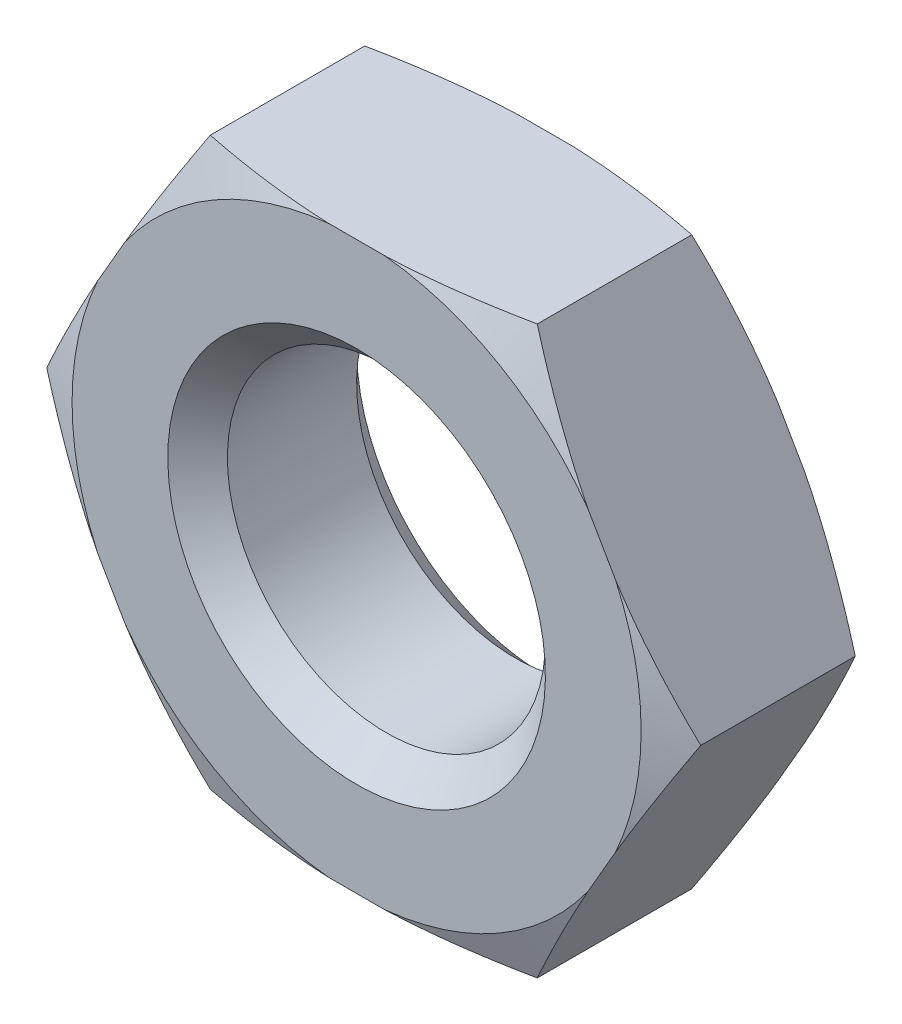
ISO-10303-21;
HEADER;
FILE_DESCRIPTION(('STEP AP214'),'2;1');
FILE_NAME('part.step','',(''),(''),'','','');
FILE_SCHEMA(('AUTOMOTIVE_DESIGN { 1 0 10303 214 1 1 1 1 }'));
ENDSEC;
DATA;
#1=APPLICATION_CONTEXT('core data for automotive mechanical design processes');
#2=APPLICATION_PROTOCOL_DEFINITION('international standard','automotive_design',2000,#1);
#3=PRODUCT_CONTEXT('',#1,'mechanical');
#4=PRODUCT('Part','Part','',(#3));
#5=PRODUCT_RELATED_PRODUCT_CATEGORY('part','',(#4));
#6=PRODUCT_DEFINITION_FORMATION('','',#4);
#7=PRODUCT_DEFINITION_CONTEXT('part definition',#1,'design');
#8=PRODUCT_DEFINITION('design','',#6,#7);
#9=PRODUCT_DEFINITION_SHAPE('','',#8);
#10=(LENGTH_UNIT() NAMED_UNIT(*) SI_UNIT(.MILLI.,.METRE.));
#11=(NAMED_UNIT(*) PLANE_ANGLE_UNIT() SI_UNIT($,.RADIAN.));
#12=(NAMED_UNIT(*) SI_UNIT($,.STERADIAN.) SOLID_ANGLE_UNIT());
#13=UNCERTAINTY_MEASURE_WITH_UNIT(LENGTH_MEASURE(1.E-05),#10,'distance_accuracy_value','');
#14=(GEOMETRIC_REPRESENTATION_CONTEXT(3) GLOBAL_UNCERTAINTY_ASSIGNED_CONTEXT((#13)) GLOBAL_UNIT_ASSIGNED_CONTEXT((#10,
#11,#12)) REPRESENTATION_CONTEXT('',''));
#15=CARTESIAN_POINT('',(0.,0.,0.));
#16=DIRECTION('',(0.,0.,1.));
#17=DIRECTION('',(1.,0.,0.));
#18=AXIS2_PLACEMENT_3D('',#15,#16,#17);
#19=CARTESIAN_POINT('',(0.,0.,0.));
#20=DIRECTION('',(0.,0.,1.));
#21=DIRECTION('',(0.,-1.,0.));
#22=AXIS2_PLACEMENT_3D('',#19,#20,#21);
#23=CONICAL_SURFACE('',#22,9.04225262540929,1.18682389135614);
#24=CARTESIAN_POINT('',(3.29337909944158,12.2956916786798,1.48958926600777));
#25=CARTESIAN_POINT('',(3.47196666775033,11.9863689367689,1.38758639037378));
#26=CARTESIAN_POINT('',(3.65095666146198,11.6763491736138,1.28829651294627));
#27=CARTESIAN_POINT('',(4.00990525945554,11.0546319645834,1.09655155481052));
#28=CARTESIAN_POINT('',(4.18986414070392,10.7429340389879,1.0040985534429));
#29=CARTESIAN_POINT('',(4.55169395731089,10.1162264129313,0.827065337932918));
#30=CARTESIAN_POINT('',(4.73356994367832,9.80120796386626,0.742526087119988));
#31=CARTESIAN_POINT('',(5.09842913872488,9.16925330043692,0.583668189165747));
#32=CARTESIAN_POINT('',(5.28141226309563,8.85231723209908,0.509348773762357));
#33=CARTESIAN_POINT('',(5.64376319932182,8.22470700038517,0.374756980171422));
#34=CARTESIAN_POINT('',(5.82310151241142,7.91408393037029,0.314169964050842));
#35=CARTESIAN_POINT('',(6.18281302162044,7.29104532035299,0.206674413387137));
#36=CARTESIAN_POINT('',(6.36318621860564,6.97862977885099,0.159765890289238));
#37=CARTESIAN_POINT('',(6.72436890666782,6.353043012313,0.0816427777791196));
#38=CARTESIAN_POINT('',(6.90517641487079,6.03987522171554,0.050392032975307));
#39=CARTESIAN_POINT('',(7.26732832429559,5.4126097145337,0.00491574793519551));
#40=CARTESIAN_POINT('',(7.44867270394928,5.09851203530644,-0.00931046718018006));
#41=CARTESIAN_POINT('',(7.80232996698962,4.48595968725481,-0.0197289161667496));
#42=CARTESIAN_POINT('',(7.97463645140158,4.18751610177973,-0.0167956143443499));
#43=CARTESIAN_POINT('',(8.31899750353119,3.59106526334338,0.00493973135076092));
#44=CARTESIAN_POINT('',(8.49105206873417,3.29305801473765,0.023741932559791));
#45=CARTESIAN_POINT('',(8.83493555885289,2.69743433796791,0.0764025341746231));
#46=CARTESIAN_POINT('',(9.00676327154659,2.39982000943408,0.110292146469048));
#47=CARTESIAN_POINT('',(9.34959805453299,1.80601274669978,0.191723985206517));
#48=CARTESIAN_POINT('',(9.52060512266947,1.509819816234,0.239266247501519));
#49=CARTESIAN_POINT('',(9.86590725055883,0.91173898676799,0.347645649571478));
#50=CARTESIAN_POINT('',(10.0401784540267,0.609892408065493,0.408783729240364));
#51=CARTESIAN_POINT('',(10.3877029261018,0.00796236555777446,0.541775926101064));
#52=CARTESIAN_POINT('',(10.5609561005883,-0.292120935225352,0.613631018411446));
#53=CARTESIAN_POINT('',(10.9057592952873,-0.889337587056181,0.765996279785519));
#54=CARTESIAN_POINT('',(11.0773133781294,-1.18647797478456,0.846470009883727));
#55=CARTESIAN_POINT('',(11.4194500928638,-1.7790761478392,1.01482955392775));
#56=CARTESIAN_POINT('',(11.5900330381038,-2.0745344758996,1.10271281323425));
#57=CARTESIAN_POINT('',(11.7601993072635,-2.36927109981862,1.1935887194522));
#58=B_SPLINE_CURVE_WITH_KNOTS('',3,(#24,#25,#26,#27,#28,#29,#30,#31,#32,#33,#34,#35,#36,#37,#38,
#39,#40,#41,#42,#43,#44,#45,#46,#47,#48,#49,#50,#51,#52,#53,#54,#55,#56,#57),.UNSPECIFIED.,.F.,
.F.,(4,2,2,2,2,2,2,2,2,2,2,2,2,2,2,2,4),(0.,1.11439696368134,2.22913147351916,3.3493493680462,
4.46948300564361,5.56053112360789,6.65158015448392,7.74009809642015,8.8285728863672,
9.86207781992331,10.8955930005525,11.9312562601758,12.9669222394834,14.0283169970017,
15.0898083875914,16.1469769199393,17.2037824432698),.UNSPECIFIED.);
#59=CARTESIAN_POINT('',(8.23080491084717,3.74381931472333,0.));
#60=VERTEX_POINT('',#59);
#61=CARTESIAN_POINT('',(10.3923,0.,0.545454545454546));
#62=VERTEX_POINT('',#61);
#63=EDGE_CURVE('E306',#60,#62,#58,.T.);
#64=ORIENTED_EDGE('',*,*,#63,.T.);
#65=CARTESIAN_POINT('',(11.7601993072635,2.36927109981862,1.1935887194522));
#66=CARTESIAN_POINT('',(11.5900330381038,2.0745344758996,1.10271281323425));
#67=CARTESIAN_POINT('',(11.4194500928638,1.7790761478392,1.01482955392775));
#68=CARTESIAN_POINT('',(11.0773133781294,1.18647797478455,0.846470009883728));
#69=CARTESIAN_POINT('',(10.9057592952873,0.889337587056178,0.76599627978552));
#70=CARTESIAN_POINT('',(10.5609561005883,0.29212093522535,0.613631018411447));
#71=CARTESIAN_POINT('',(10.3877029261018,-0.00796236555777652,0.541775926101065));
#72=CARTESIAN_POINT('',(10.0401784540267,-0.609892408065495,0.408783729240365));
#73=CARTESIAN_POINT('',(9.86590725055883,-0.911738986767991,0.347645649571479));
#74=CARTESIAN_POINT('',(9.52060512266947,-1.509819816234,0.239266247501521));
#75=CARTESIAN_POINT('',(9.34959805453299,-1.80601274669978,0.191723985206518));
#76=CARTESIAN_POINT('',(9.00676327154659,-2.39982000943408,0.11029214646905));
#77=CARTESIAN_POINT('',(8.83493555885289,-2.69743433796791,0.0764025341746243));
#78=CARTESIAN_POINT('',(8.49105206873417,-3.29305801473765,0.023741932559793));
#79=CARTESIAN_POINT('',(8.31899750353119,-3.59106526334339,0.00493973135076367));
#80=CARTESIAN_POINT('',(7.97463645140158,-4.18751610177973,-0.0167956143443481));
#81=CARTESIAN_POINT('',(7.80232996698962,-4.48595968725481,-0.0197289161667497));
#82=CARTESIAN_POINT('',(7.44867270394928,-5.09851203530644,-0.00931046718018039));
#83=CARTESIAN_POINT('',(7.26732832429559,-5.4126097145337,0.00491574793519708));
#84=CARTESIAN_POINT('',(6.90517641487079,-6.03987522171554,0.0503920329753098));
#85=CARTESIAN_POINT('',(6.72436890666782,-6.35304301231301,0.0816427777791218));
#86=CARTESIAN_POINT('',(6.36318621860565,-6.97862977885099,0.15976589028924));
#87=CARTESIAN_POINT('',(6.18281302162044,-7.291045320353,0.206674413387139));
#88=CARTESIAN_POINT('',(5.82310151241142,-7.9140839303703,0.314169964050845));
#89=CARTESIAN_POINT('',(5.64376319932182,-8.22470700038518,0.374756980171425));
#90=CARTESIAN_POINT('',(5.28141226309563,-8.85231723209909,0.50934877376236));
#91=CARTESIAN_POINT('',(5.09842913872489,-9.16925330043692,0.58366818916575));
#92=CARTESIAN_POINT('',(4.73356994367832,-9.80120796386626,0.742526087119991));
#93=CARTESIAN_POINT('',(4.55169395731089,-10.1162264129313,0.82706533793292));
#94=CARTESIAN_POINT('',(4.18986414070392,-10.742934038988,1.00409855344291));
#95=CARTESIAN_POINT('',(4.00990525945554,-11.0546319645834,1.09655155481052));
#96=CARTESIAN_POINT('',(3.65095666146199,-11.6763491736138,1.28829651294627));
#97=CARTESIAN_POINT('',(3.47196666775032,-11.9863689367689,1.38758639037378));
#98=CARTESIAN_POINT('',(3.29337909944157,-12.2956916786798,1.48958926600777));
#99=B_SPLINE_CURVE_WITH_KNOTS('',3,(#65,#66,#67,#68,#69,#70,#71,#72,#73,#74,#75,#76,#77,#78,#79,
#80,#81,#82,#83,#84,#85,#86,#87,#88,#89,#90,#91,#92,#93,#94,#95,#96,#97,#98),.UNSPECIFIED.,.F.,
.F.,(4,2,2,2,2,2,2,2,2,2,2,2,2,2,2,2,4),(0.,1.05680552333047,2.11397405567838,3.17546544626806,
4.23686020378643,5.27252618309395,6.30818944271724,7.34170462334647,8.37520955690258,
9.46368434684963,10.5522022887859,11.6432513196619,12.7342994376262,13.8544330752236,
14.9746509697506,16.0893854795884,17.2037824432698),.UNSPECIFIED.);
#100=CARTESIAN_POINT('',(8.23080491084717,-3.74381931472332,0.));
#101=VERTEX_POINT('',#100);
#102=EDGE_CURVE('E33',#62,#101,#99,.T.);
#103=ORIENTED_EDGE('',*,*,#102,.T.);
#104=CARTESIAN_POINT('',(0.,0.,0.));
#105=DIRECTION('',(0.,0.,1.));
#106=DIRECTION('',(1.,0.,0.));
#107=AXIS2_PLACEMENT_3D('',#104,#105,#106);
#108=CIRCLE('',#107,9.04225262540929);
#109=EDGE_CURVE('E311',#101,#60,#108,.T.);
#110=ORIENTED_EDGE('',*,*,#109,.T.);
#111=EDGE_LOOP('',(#64,#103,#110));
#112=FACE_BOUND('',#111,.T.);
#113=ADVANCED_FACE('F16',(#112),#23,.T.);
#114=CARTESIAN_POINT('',(10.3923,0.,0.));
#115=DIRECTION('',(0.,0.,1.));
#116=DIRECTION('',(1.,0.,0.));
#117=AXIS2_PLACEMENT_3D('',#114,#115,#116);
#118=PLANE('',#117);
#119=CARTESIAN_POINT('',(0.,0.,0.));
#120=DIRECTION('',(0.,0.,-1.));
#121=DIRECTION('',(0.,1.,0.));
#122=AXIS2_PLACEMENT_3D('',#119,#120,#121);
#123=CIRCLE('',#122,9.04225262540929);
#124=CARTESIAN_POINT('',(0.873159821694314,8.99999580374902,0.));
#125=VERTEX_POINT('',#124);
#126=CARTESIAN_POINT('',(7.35764508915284,5.25617648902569,0.));
#127=VERTEX_POINT('',#126);
#128=EDGE_CURVE('E151',#125,#127,#123,.T.);
#129=ORIENTED_EDGE('',*,*,#128,.T.);
#130=DIRECTION('',(-0.5,0.866025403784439,0.));
#131=VECTOR('',#130,1.);
#132=CARTESIAN_POINT('',(10.3923,0.,0.));
#133=LINE('',#132,#131);
#134=EDGE_CURVE('E157',#60,#127,#133,.T.);
#135=ORIENTED_EDGE('',*,*,#134,.F.);
#136=ORIENTED_EDGE('',*,*,#109,.F.);
#137=DIRECTION('',(0.5,0.866025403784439,0.));
#138=VECTOR('',#137,1.);
#139=CARTESIAN_POINT('',(5.19615,-8.99999580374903,0.));
#140=LINE('',#139,#138);
#141=CARTESIAN_POINT('',(7.35764508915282,-5.2561764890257,0.));
#142=VERTEX_POINT('',#141);
#143=EDGE_CURVE('E352',#142,#101,#140,.T.);
#144=ORIENTED_EDGE('',*,*,#143,.F.);
#145=CARTESIAN_POINT('',(0.873159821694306,-8.99999580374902,0.));
#146=VERTEX_POINT('',#145);
#147=EDGE_CURVE('E318',#146,#142,#108,.T.);
#148=ORIENTED_EDGE('',*,*,#147,.F.);
#149=DIRECTION('',(1.,0.,0.));
#150=VECTOR('',#149,1.);
#151=CARTESIAN_POINT('',(-5.19615,-8.99999580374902,0.));
#152=LINE('',#151,#150);
#153=CARTESIAN_POINT('',(-0.873159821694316,-8.99999580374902,0.));
#154=VERTEX_POINT('',#153);
#155=EDGE_CURVE('E338',#154,#146,#152,.T.);
#156=ORIENTED_EDGE('',*,*,#155,.F.);
#157=CARTESIAN_POINT('',(-7.35764508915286,-5.25617648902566,0.));
#158=VERTEX_POINT('',#157);
#159=EDGE_CURVE('E391',#158,#154,#108,.T.);
#160=ORIENTED_EDGE('',*,*,#159,.F.);
#161=DIRECTION('',(0.5,-0.866025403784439,0.));
#162=VECTOR('',#161,1.);
#163=CARTESIAN_POINT('',(-10.3923,0.,0.));
#164=LINE('',#163,#162);
#165=CARTESIAN_POINT('',(-8.23080491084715,-3.74381931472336,0.));
#166=VERTEX_POINT('',#165);
#167=EDGE_CURVE('E357',#166,#158,#164,.T.);
#168=ORIENTED_EDGE('',*,*,#167,.F.);
#169=CARTESIAN_POINT('',(-8.23080491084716,3.74381931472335,0.));
#170=VERTEX_POINT('',#169);
#171=EDGE_CURVE('E369',#170,#166,#108,.T.);
#172=ORIENTED_EDGE('',*,*,#171,.F.);
#173=DIRECTION('',(-0.5,-0.866025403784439,0.));
#174=VECTOR('',#173,1.);
#175=CARTESIAN_POINT('',(-5.19615,8.99999580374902,0.));
#176=LINE('',#175,#174);
#177=CARTESIAN_POINT('',(-7.35764508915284,5.25617648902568,0.));
#178=VERTEX_POINT('',#177);
#179=EDGE_CURVE('E156',#178,#170,#176,.T.);
#180=ORIENTED_EDGE('',*,*,#179,.F.);
#181=CARTESIAN_POINT('',(-0.873159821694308,8.99999580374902,0.));
#182=VERTEX_POINT('',#181);
#183=EDGE_CURVE('E153',#182,#178,#108,.T.);
#184=ORIENTED_EDGE('',*,*,#183,.F.);
#185=DIRECTION('',(-1.,0.,0.));
#186=VECTOR('',#185,1.);
#187=CARTESIAN_POINT('',(5.19615,8.99999580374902,0.));
#188=LINE('',#187,#186);
#189=EDGE_CURVE('E146',#125,#182,#188,.T.);
#190=ORIENTED_EDGE('',*,*,#189,.F.);
#191=EDGE_LOOP('',(#129,#135,#136,#144,#148,#156,#160,#168,#172,#180,#184,#190));
#192=FACE_BOUND('',#191,.T.);
#193=CARTESIAN_POINT('',(0.,0.,0.));
#194=DIRECTION('',(0.,0.,-1.));
#195=DIRECTION('',(0.,1.,0.));
#196=AXIS2_PLACEMENT_3D('',#193,#194,#195);
#197=CIRCLE('',#196,6.);
#198=CARTESIAN_POINT('',(0.,6.,0.));
#199=VERTEX_POINT('',#198);
#200=EDGE_CURVE('E169',#199,#199,#197,.T.);
#201=ORIENTED_EDGE('',*,*,#200,.F.);
#202=EDGE_LOOP('',(#201));
#203=FACE_BOUND('',#202,.T.);
#204=ADVANCED_FACE('F148',(#192,#203),#118,.F.);
#205=CARTESIAN_POINT('',(5.19615,-8.99999580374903,6.));
#206=DIRECTION('',(-0.866025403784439,0.5,0.));
#207=DIRECTION('',(-0.5,-0.866025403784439,0.));
#208=AXIS2_PLACEMENT_3D('',#205,#206,#207);
#209=PLANE('',#208);
#210=CARTESIAN_POINT('',(3.29337909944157,-12.2956916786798,4.51041073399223));
#211=CARTESIAN_POINT('',(3.47196666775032,-11.9863689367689,4.61241360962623));
#212=CARTESIAN_POINT('',(3.65095666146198,-11.6763491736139,4.71170348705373));
#213=CARTESIAN_POINT('',(4.00990525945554,-11.0546319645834,4.90344844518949));
#214=CARTESIAN_POINT('',(4.18986414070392,-10.742934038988,4.9959014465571));
#215=CARTESIAN_POINT('',(4.55169395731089,-10.1162264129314,5.17293466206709));
#216=CARTESIAN_POINT('',(4.73356994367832,-9.80120796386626,5.25747391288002));
#217=CARTESIAN_POINT('',(5.09842913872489,-9.16925330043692,5.41633181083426));
#218=CARTESIAN_POINT('',(5.28141226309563,-8.85231723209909,5.49065122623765));
#219=CARTESIAN_POINT('',(5.64376319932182,-8.22470700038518,5.62524301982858));
#220=CARTESIAN_POINT('',(5.82310151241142,-7.91408393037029,5.68583003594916));
#221=CARTESIAN_POINT('',(6.18281302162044,-7.291045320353,5.79332558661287));
#222=CARTESIAN_POINT('',(6.36318621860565,-6.97862977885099,5.84023410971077));
#223=CARTESIAN_POINT('',(6.72436890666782,-6.35304301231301,5.91835722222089));
#224=CARTESIAN_POINT('',(6.90517641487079,-6.03987522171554,5.9496079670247));
#225=CARTESIAN_POINT('',(7.26732832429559,-5.4126097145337,5.99508425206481));
#226=CARTESIAN_POINT('',(7.44867270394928,-5.09851203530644,6.00931046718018));
#227=CARTESIAN_POINT('',(7.80232996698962,-4.48595968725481,6.01972891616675));
#228=CARTESIAN_POINT('',(7.97463645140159,-4.18751610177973,6.01679561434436));
#229=CARTESIAN_POINT('',(8.31899750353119,-3.59106526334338,5.99506026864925));
#230=CARTESIAN_POINT('',(8.49105206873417,-3.29305801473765,5.97625806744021));
#231=CARTESIAN_POINT('',(8.83493555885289,-2.6974343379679,5.92359746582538));
#232=CARTESIAN_POINT('',(9.00676327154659,-2.39982000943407,5.88970785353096));
#233=CARTESIAN_POINT('',(9.34959805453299,-1.80601274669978,5.80827601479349));
#234=CARTESIAN_POINT('',(9.52060512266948,-1.50981981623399,5.76073375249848));
#235=CARTESIAN_POINT('',(9.86590725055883,-0.911738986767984,5.65235435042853));
#236=CARTESIAN_POINT('',(10.0401784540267,-0.609892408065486,5.59121627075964));
#237=CARTESIAN_POINT('',(10.3877029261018,-0.00796236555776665,5.45822407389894));
#238=CARTESIAN_POINT('',(10.5609561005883,0.29212093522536,5.38636898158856));
#239=CARTESIAN_POINT('',(10.9057592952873,0.88933758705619,5.23400372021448));
#240=CARTESIAN_POINT('',(11.0773133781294,1.18647797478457,5.15352999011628));
#241=CARTESIAN_POINT('',(11.4194500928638,1.77907614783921,4.98517044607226));
#242=CARTESIAN_POINT('',(11.5900330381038,2.07453447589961,4.89728718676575));
#243=CARTESIAN_POINT('',(11.7601993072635,2.36927109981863,4.8064112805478));
#244=B_SPLINE_CURVE_WITH_KNOTS('',3,(#210,#211,#212,#213,#214,#215,#216,#217,#218,#219,#220,
#221,#222,#223,#224,#225,#226,#227,#228,#229,#230,#231,#232,#233,#234,#235,#236,#237,#238,#239,
#240,#241,#242,#243),.UNSPECIFIED.,.F.,.F.,(4,2,2,2,2,2,2,2,2,2,2,2,2,2,2,2,4),(0.,
1.11439696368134,2.22913147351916,3.3493493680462,4.46948300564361,5.5605311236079,
6.65158015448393,7.74009809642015,8.8285728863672,9.86207781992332,10.8955930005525,
11.9312562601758,12.9669222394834,14.0283169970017,15.0898083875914,16.1469769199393,
17.2037824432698),.UNSPECIFIED.);
#245=CARTESIAN_POINT('',(5.19615,-8.99999580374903,5.45454545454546));
#246=VERTEX_POINT('',#245);
#247=CARTESIAN_POINT('',(7.35764508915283,-5.25617648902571,6.));
#248=VERTEX_POINT('',#247);
#249=EDGE_CURVE('E222',#246,#248,#244,.T.);
#250=ORIENTED_EDGE('',*,*,#249,.F.);
#251=DIRECTION('',(0.,0.,-1.));
#252=VECTOR('',#251,1.);
#253=CARTESIAN_POINT('',(5.19615,-8.99999580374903,6.));
#254=LINE('',#253,#252);
#255=CARTESIAN_POINT('',(5.19615,-8.99999580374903,0.545454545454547));
#256=VERTEX_POINT('',#255);
#257=EDGE_CURVE('E330',#246,#256,#254,.T.);
#258=ORIENTED_EDGE('',*,*,#257,.T.);
#259=EDGE_CURVE('E295',#142,#256,#99,.T.);
#260=ORIENTED_EDGE('',*,*,#259,.F.);
#261=ORIENTED_EDGE('',*,*,#143,.T.);
#262=ORIENTED_EDGE('',*,*,#102,.F.);
#263=DIRECTION('',(0.,0.,-1.));
#264=VECTOR('',#263,1.);
#265=CARTESIAN_POINT('',(10.3923,0.,6.));
#266=LINE('',#265,#264);
#267=CARTESIAN_POINT('',(10.3923,0.,5.45454545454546));
#268=VERTEX_POINT('',#267);
#269=EDGE_CURVE('E313',#268,#62,#266,.T.);
#270=ORIENTED_EDGE('',*,*,#269,.F.);
#271=CARTESIAN_POINT('',(8.23080491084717,-3.74381931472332,6.));
#272=VERTEX_POINT('',#271);
#273=EDGE_CURVE('E354',#272,#268,#244,.T.);
#274=ORIENTED_EDGE('',*,*,#273,.F.);
#275=DIRECTION('',(0.5,0.866025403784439,0.));
#276=VECTOR('',#275,1.);
#277=CARTESIAN_POINT('',(5.19615,-8.99999580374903,6.));
#278=LINE('',#277,#276);
#279=EDGE_CURVE('E334',#248,#272,#278,.T.);
#280=ORIENTED_EDGE('',*,*,#279,.F.);
#281=EDGE_LOOP('',(#250,#258,#260,#261,#262,#270,#274,#280));
#282=FACE_BOUND('',#281,.T.);
#283=ADVANCED_FACE('F18',(#282),#209,.F.);
#284=CARTESIAN_POINT('',(10.3923,0.,6.));
#285=DIRECTION('',(-0.866025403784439,-0.5,0.));
#286=DIRECTION('',(0.5,-0.866025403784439,0.));
#287=AXIS2_PLACEMENT_3D('',#284,#285,#286);
#288=PLANE('',#287);
#289=CARTESIAN_POINT('',(11.7601993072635,-2.36927109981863,4.8064112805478));
#290=CARTESIAN_POINT('',(11.5900330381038,-2.07453447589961,4.89728718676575));
#291=CARTESIAN_POINT('',(11.4194500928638,-1.77907614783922,4.98517044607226));
#292=CARTESIAN_POINT('',(11.0773133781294,-1.18647797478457,5.15352999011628));
#293=CARTESIAN_POINT('',(10.9057592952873,-0.889337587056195,5.23400372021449));
#294=CARTESIAN_POINT('',(10.5609561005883,-0.292120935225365,5.38636898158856));
#295=CARTESIAN_POINT('',(10.3877029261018,0.00796236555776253,5.45822407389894));
#296=CARTESIAN_POINT('',(10.0401784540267,0.609892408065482,5.59121627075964));
#297=CARTESIAN_POINT('',(9.86590725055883,0.911738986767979,5.65235435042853));
#298=CARTESIAN_POINT('',(9.52060512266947,1.50981981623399,5.76073375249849));
#299=CARTESIAN_POINT('',(9.34959805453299,1.80601274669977,5.80827601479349));
#300=CARTESIAN_POINT('',(9.00676327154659,2.39982000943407,5.88970785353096));
#301=CARTESIAN_POINT('',(8.83493555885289,2.6974343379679,5.92359746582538));
#302=CARTESIAN_POINT('',(8.49105206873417,3.29305801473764,5.97625806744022));
#303=CARTESIAN_POINT('',(8.31899750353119,3.59106526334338,5.99506026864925));
#304=CARTESIAN_POINT('',(7.97463645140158,4.18751610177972,6.01679561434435));
#305=CARTESIAN_POINT('',(7.80232996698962,4.48595968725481,6.01972891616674));
#306=CARTESIAN_POINT('',(7.44867270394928,5.09851203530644,6.00931046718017));
#307=CARTESIAN_POINT('',(7.26732832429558,5.4126097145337,5.99508425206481));
#308=CARTESIAN_POINT('',(6.90517641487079,6.03987522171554,5.9496079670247));
#309=CARTESIAN_POINT('',(6.72436890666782,6.35304301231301,5.91835722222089));
#310=CARTESIAN_POINT('',(6.36318621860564,6.97862977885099,5.84023410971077));
#311=CARTESIAN_POINT('',(6.18281302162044,7.291045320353,5.79332558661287));
#312=CARTESIAN_POINT('',(5.82310151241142,7.91408393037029,5.68583003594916));
#313=CARTESIAN_POINT('',(5.64376319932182,8.22470700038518,5.62524301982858));
#314=CARTESIAN_POINT('',(5.28141226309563,8.85231723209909,5.49065122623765));
#315=CARTESIAN_POINT('',(5.09842913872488,9.16925330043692,5.41633181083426));
#316=CARTESIAN_POINT('',(4.73356994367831,9.80120796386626,5.25747391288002));
#317=CARTESIAN_POINT('',(4.55169395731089,10.1162264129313,5.17293466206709));
#318=CARTESIAN_POINT('',(4.18986414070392,10.742934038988,4.9959014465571));
#319=CARTESIAN_POINT('',(4.00990525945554,11.0546319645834,4.90344844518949));
#320=CARTESIAN_POINT('',(3.65095666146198,11.6763491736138,4.71170348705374));
#321=CARTESIAN_POINT('',(3.47196666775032,11.9863689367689,4.61241360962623));
#322=CARTESIAN_POINT('',(3.29337909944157,12.2956916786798,4.51041073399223));
#323=B_SPLINE_CURVE_WITH_KNOTS('',3,(#289,#290,#291,#292,#293,#294,#295,#296,#297,#298,#299,
#300,#301,#302,#303,#304,#305,#306,#307,#308,#309,#310,#311,#312,#313,#314,#315,#316,#317,#318,
#319,#320,#321,#322),.UNSPECIFIED.,.F.,.F.,(4,2,2,2,2,2,2,2,2,2,2,2,2,2,2,2,4),(0.,
1.05680552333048,2.11397405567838,3.17546544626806,4.23686020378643,5.27252618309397,
6.30818944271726,7.34170462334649,8.3752095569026,9.46368434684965,10.5522022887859,
11.6432513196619,12.7342994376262,13.8544330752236,14.9746509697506,16.0893854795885,
17.2037824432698),.UNSPECIFIED.);
#324=CARTESIAN_POINT('',(8.23080491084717,3.74381931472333,6.));
#325=VERTEX_POINT('',#324);
#326=EDGE_CURVE('E315',#268,#325,#323,.T.);
#327=ORIENTED_EDGE('',*,*,#326,.F.);
#328=ORIENTED_EDGE('',*,*,#269,.T.);
#329=ORIENTED_EDGE('',*,*,#63,.F.);
#330=ORIENTED_EDGE('',*,*,#134,.T.);
#331=CARTESIAN_POINT('',(5.19615,8.99999580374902,0.545454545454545));
#332=VERTEX_POINT('',#331);
#333=EDGE_CURVE('E41',#332,#127,#58,.T.);
#334=ORIENTED_EDGE('',*,*,#333,.F.);
#335=DIRECTION('',(0.,0.,-1.));
#336=VECTOR('',#335,1.);
#337=CARTESIAN_POINT('',(5.19615,8.99999580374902,6.));
#338=LINE('',#337,#336);
#339=CARTESIAN_POINT('',(5.19615,8.99999580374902,5.45454545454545));
#340=VERTEX_POINT('',#339);
#341=EDGE_CURVE('E163',#340,#332,#338,.T.);
#342=ORIENTED_EDGE('',*,*,#341,.F.);
#343=CARTESIAN_POINT('',(7.35764508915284,5.25617648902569,6.));
#344=VERTEX_POINT('',#343);
#345=EDGE_CURVE('E269',#344,#340,#323,.T.);
#346=ORIENTED_EDGE('',*,*,#345,.F.);
#347=DIRECTION('',(-0.5,0.866025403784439,0.));
#348=VECTOR('',#347,1.);
#349=CARTESIAN_POINT('',(10.3923,0.,6.));
#350=LINE('',#349,#348);
#351=EDGE_CURVE('E337',#325,#344,#350,.T.);
#352=ORIENTED_EDGE('',*,*,#351,.F.);
#353=EDGE_LOOP('',(#327,#328,#329,#330,#334,#342,#346,#352));
#354=FACE_BOUND('',#353,.T.);
#355=ADVANCED_FACE('F278',(#354),#288,.F.);
#356=CARTESIAN_POINT('',(5.19615,8.99999580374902,6.));
#357=DIRECTION('',(0.,-1.,0.));
#358=DIRECTION('',(1.,0.,0.));
#359=AXIS2_PLACEMENT_3D('',#356,#357,#358);
#360=PLANE('',#359);
#361=CARTESIAN_POINT('',(-13.7668000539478,8.99999580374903,3.00803117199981));
#362=CARTESIAN_POINT('',(-13.3605227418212,8.99999580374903,3.14538424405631));
#363=CARTESIAN_POINT('',(-12.9537068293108,8.99999580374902,3.28117343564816));
#364=CARTESIAN_POINT('',(-12.138719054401,8.99999580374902,3.54875043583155));
#365=CARTESIAN_POINT('',(-11.7305470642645,8.99999580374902,3.6805378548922));
#366=CARTESIAN_POINT('',(-10.9116684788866,8.99999580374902,3.93952020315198));
#367=CARTESIAN_POINT('',(-10.5009581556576,8.99999580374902,4.06670338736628));
#368=CARTESIAN_POINT('',(-9.67768803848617,8.99999580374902,4.31492338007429));
#369=CARTESIAN_POINT('',(-9.26512828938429,8.99999580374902,4.43596033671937));
#370=CARTESIAN_POINT('',(-8.44310919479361,8.99999580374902,4.66884098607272));
#371=CARTESIAN_POINT('',(-8.03367769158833,8.99999580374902,4.78078246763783));
#372=CARTESIAN_POINT('',(-7.21232873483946,8.99999580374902,4.99526167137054));
#373=CARTESIAN_POINT('',(-6.80041120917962,8.99999580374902,5.0977991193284));
#374=CARTESIAN_POINT('',(-5.97402410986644,8.99999580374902,5.29103208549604));
#375=CARTESIAN_POINT('',(-5.5595560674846,8.99999580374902,5.38173409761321));
#376=CARTESIAN_POINT('',(-4.72767241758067,8.99999580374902,5.54850195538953));
#377=CARTESIAN_POINT('',(-4.31025702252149,8.99999580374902,5.62456884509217));
#378=CARTESIAN_POINT('',(-3.55816105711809,8.99999580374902,5.74516145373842));
#379=CARTESIAN_POINT('',(-3.22400733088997,8.99999580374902,5.79295615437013));
#380=CARTESIAN_POINT('',(-2.55409875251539,8.99999580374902,5.87567941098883));
#381=CARTESIAN_POINT('',(-2.21834394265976,8.99999580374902,5.91060830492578));
#382=CARTESIAN_POINT('',(-1.54586285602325,8.99999580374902,5.96621810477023));
#383=CARTESIAN_POINT('',(-1.20913736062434,8.99999580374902,5.98690833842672));
#384=CARTESIAN_POINT('',(-0.535091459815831,8.99999580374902,6.01317318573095));
#385=CARTESIAN_POINT('',(-0.197771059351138,8.99999580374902,6.01874792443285));
#386=CARTESIAN_POINT('',(0.478397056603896,8.99999580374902,6.01451406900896));
#387=CARTESIAN_POINT('',(0.817244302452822,8.99999580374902,6.00463124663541));
#388=CARTESIAN_POINT('',(1.4941576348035,8.99999580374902,5.9698001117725));
#389=CARTESIAN_POINT('',(1.83222370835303,8.99999580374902,5.9448515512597));
#390=CARTESIAN_POINT('',(2.50722993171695,8.99999580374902,5.88094090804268));
#391=CARTESIAN_POINT('',(2.84416922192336,8.99999580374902,5.84196986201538));
#392=CARTESIAN_POINT('',(3.51633839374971,8.99999580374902,5.75149124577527));
#393=CARTESIAN_POINT('',(3.85156828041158,8.99999580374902,5.69998371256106));
#394=CARTESIAN_POINT('',(4.57663026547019,8.99999580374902,5.57644721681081));
#395=CARTESIAN_POINT('',(4.96611991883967,8.99999580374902,5.50242146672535));
#396=CARTESIAN_POINT('',(5.74257029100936,8.99999580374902,5.34203031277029));
#397=CARTESIAN_POINT('',(6.12953068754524,8.99999580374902,5.25566336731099));
#398=CARTESIAN_POINT('',(6.90124523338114,8.99999580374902,5.0728299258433));
#399=CARTESIAN_POINT('',(7.28599818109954,8.99999580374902,4.97635839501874));
#400=CARTESIAN_POINT('',(8.05334112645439,8.99999580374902,4.77527042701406));
#401=CARTESIAN_POINT('',(8.43593120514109,8.99999580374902,4.67065429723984));
#402=CARTESIAN_POINT('',(9.20025348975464,8.99999580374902,4.4545416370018));
#403=CARTESIAN_POINT('',(9.58198071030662,8.99999580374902,4.34302755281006));
#404=CARTESIAN_POINT('',(10.3438193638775,8.99999580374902,4.11461969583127));
#405=CARTESIAN_POINT('',(10.7239307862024,8.99999580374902,3.99772588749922));
#406=CARTESIAN_POINT('',(11.4826662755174,8.99999580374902,3.75958382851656));
#407=CARTESIAN_POINT('',(11.8612907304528,8.99999580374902,3.63833681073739));
#408=CARTESIAN_POINT('',(12.6173660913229,8.99999580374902,3.39223250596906));
#409=CARTESIAN_POINT('',(12.9948169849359,8.99999580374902,3.26737518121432));
#410=CARTESIAN_POINT('',(14.1207596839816,8.99999580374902,2.88999972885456));
#411=CARTESIAN_POINT('',(14.8677848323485,8.99999580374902,2.63310714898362));
#412=CARTESIAN_POINT('',(16.3590071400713,8.99999580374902,2.11110936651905));
#413=CARTESIAN_POINT('',(17.1032040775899,8.99999580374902,1.84600353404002));
#414=CARTESIAN_POINT('',(18.5844808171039,8.99999580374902,1.3116338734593));
#415=CARTESIAN_POINT('',(19.3215749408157,8.99999580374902,1.04240968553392));
#416=CARTESIAN_POINT('',(20.4259560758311,8.99999580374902,0.635309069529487));
#417=CARTESIAN_POINT('',(20.793849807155,8.99999580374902,0.499073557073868));
#418=CARTESIAN_POINT('',(21.5292786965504,8.99999580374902,0.225642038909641));
#419=CARTESIAN_POINT('',(21.8968138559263,8.99999580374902,0.0884460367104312));
#420=CARTESIAN_POINT('',(22.2641939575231,8.99999580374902,-0.0491641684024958));
#421=B_SPLINE_CURVE_WITH_KNOTS('',3,(#361,#362,#363,#364,#365,#366,#367,#368,#369,#370,#371,
#372,#373,#374,#375,#376,#377,#378,#379,#380,#381,#382,#383,#384,#385,#386,#387,#388,#389,#390,
#391,#392,#393,#394,#395,#396,#397,#398,#399,#400,#401,#402,#403,#404,#405,#406,#407,#408,#409,
#410,#411,#412,#413,#414,#415,#416,#417,#418,#419,#420),.UNSPECIFIED.,.F.,.F.,(4,2,2,2,2,2,2,2,
2,2,2,2,2,2,2,2,2,2,2,2,2,2,2,2,2,2,2,2,2,4),(0.,1.28661260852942,2.57335005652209,
3.86316678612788,5.15295241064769,6.42624025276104,7.69956521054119,8.97218855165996,
10.2447210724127,11.257169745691,12.2695918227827,13.281350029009,14.2930998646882,
15.3097231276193,16.3263631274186,17.3436541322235,18.3609421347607,19.5500775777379,
20.7393616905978,21.9292412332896,23.1190758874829,24.3120740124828,25.5050800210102,
26.6977507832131,27.8904340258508,30.2602416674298,32.6302315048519,34.9843790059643,
36.1613033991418,37.338223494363),.UNSPECIFIED.);
#422=CARTESIAN_POINT('',(0.873159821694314,8.99999580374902,6.));
#423=VERTEX_POINT('',#422);
#424=EDGE_CURVE('E267',#340,#423,#421,.F.);
#425=ORIENTED_EDGE('',*,*,#424,.F.);
#426=ORIENTED_EDGE('',*,*,#341,.T.);
#427=CARTESIAN_POINT('',(-13.7668000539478,8.99999580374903,2.9919688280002));
#428=CARTESIAN_POINT('',(-13.3605227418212,8.99999580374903,2.8546157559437));
#429=CARTESIAN_POINT('',(-12.9537068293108,8.99999580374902,2.71882656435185));
#430=CARTESIAN_POINT('',(-12.138719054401,8.99999580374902,2.45124956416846));
#431=CARTESIAN_POINT('',(-11.7305470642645,8.99999580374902,2.31946214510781));
#432=CARTESIAN_POINT('',(-10.9116684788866,8.99999580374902,2.06047979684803));
#433=CARTESIAN_POINT('',(-10.5009581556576,8.99999580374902,1.93329661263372));
#434=CARTESIAN_POINT('',(-9.67768803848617,8.99999580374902,1.68507661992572));
#435=CARTESIAN_POINT('',(-9.26512828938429,8.99999580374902,1.56403966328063));
#436=CARTESIAN_POINT('',(-8.44310919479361,8.99999580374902,1.33115901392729));
#437=CARTESIAN_POINT('',(-8.03367769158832,8.99999580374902,1.21921753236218));
#438=CARTESIAN_POINT('',(-7.21232873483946,8.99999580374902,1.00473832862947));
#439=CARTESIAN_POINT('',(-6.80041120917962,8.99999580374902,0.902200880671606));
#440=CARTESIAN_POINT('',(-5.97402410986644,8.99999580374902,0.708967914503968));
#441=CARTESIAN_POINT('',(-5.5595560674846,8.99999580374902,0.618265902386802));
#442=CARTESIAN_POINT('',(-4.72767241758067,8.99999580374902,0.451498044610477));
#443=CARTESIAN_POINT('',(-4.31025702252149,8.99999580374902,0.375431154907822));
#444=CARTESIAN_POINT('',(-3.5581610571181,8.99999580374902,0.254838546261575));
#445=CARTESIAN_POINT('',(-3.22400733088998,8.99999580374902,0.207043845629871));
#446=CARTESIAN_POINT('',(-2.55409875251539,8.99999580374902,0.124320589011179));
#447=CARTESIAN_POINT('',(-2.21834394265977,8.99999580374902,0.0893916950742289));
#448=CARTESIAN_POINT('',(-1.54586285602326,8.99999580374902,0.033781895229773));
#449=CARTESIAN_POINT('',(-1.20913736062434,8.99999580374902,0.0130916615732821));
#450=CARTESIAN_POINT('',(-0.53509145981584,8.99999580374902,-0.0131731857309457));
#451=CARTESIAN_POINT('',(-0.197771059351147,8.99999580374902,-0.0187479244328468));
#452=CARTESIAN_POINT('',(0.478397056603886,8.99999580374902,-0.0145140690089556));
#453=CARTESIAN_POINT('',(0.817244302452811,8.99999580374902,-0.00463124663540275));
#454=CARTESIAN_POINT('',(1.49415763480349,8.99999580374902,0.0301998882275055));
#455=CARTESIAN_POINT('',(1.83222370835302,8.99999580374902,0.0551484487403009));
#456=CARTESIAN_POINT('',(2.50722993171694,8.99999580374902,0.119059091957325));
#457=CARTESIAN_POINT('',(2.84416922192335,8.99999580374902,0.158030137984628));
#458=CARTESIAN_POINT('',(3.5163383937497,8.99999580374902,0.248508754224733));
#459=CARTESIAN_POINT('',(3.85156828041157,8.99999580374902,0.300016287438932));
#460=CARTESIAN_POINT('',(4.57663026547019,8.99999580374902,0.423552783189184));
#461=CARTESIAN_POINT('',(4.96611991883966,8.99999580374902,0.497578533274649));
#462=CARTESIAN_POINT('',(5.74257029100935,8.99999580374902,0.657969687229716));
#463=CARTESIAN_POINT('',(6.12953068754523,8.99999580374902,0.744336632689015));
#464=CARTESIAN_POINT('',(6.90124523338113,8.99999580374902,0.927170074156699));
#465=CARTESIAN_POINT('',(7.28599818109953,8.99999580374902,1.02364160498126));
#466=CARTESIAN_POINT('',(8.05334112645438,8.99999580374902,1.22472957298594));
#467=CARTESIAN_POINT('',(8.43593120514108,8.99999580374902,1.32934570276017));
#468=CARTESIAN_POINT('',(9.20025348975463,8.99999580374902,1.54545836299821));
#469=CARTESIAN_POINT('',(9.58198071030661,8.99999580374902,1.65697244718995));
#470=CARTESIAN_POINT('',(10.3438193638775,8.99999580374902,1.88538030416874));
#471=CARTESIAN_POINT('',(10.7239307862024,8.99999580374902,2.00227411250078));
#472=CARTESIAN_POINT('',(11.4826662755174,8.99999580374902,2.24041617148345));
#473=CARTESIAN_POINT('',(11.8612907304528,8.99999580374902,2.36166318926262));
#474=CARTESIAN_POINT('',(12.6173660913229,8.99999580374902,2.60776749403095));
#475=CARTESIAN_POINT('',(12.9948169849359,8.99999580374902,2.73262481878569));
#476=CARTESIAN_POINT('',(14.1207596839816,8.99999580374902,3.11000027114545));
#477=CARTESIAN_POINT('',(14.8677848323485,8.99999580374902,3.36689285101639));
#478=CARTESIAN_POINT('',(16.3590071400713,8.99999580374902,3.88889063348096));
#479=CARTESIAN_POINT('',(17.1032040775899,8.99999580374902,4.15399646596));
#480=CARTESIAN_POINT('',(18.5844808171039,8.99999580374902,4.68836612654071));
#481=CARTESIAN_POINT('',(19.3215749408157,8.99999580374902,4.95759031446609));
#482=CARTESIAN_POINT('',(20.4259560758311,8.99999580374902,5.36469093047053));
#483=CARTESIAN_POINT('',(20.793849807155,8.99999580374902,5.50092644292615));
#484=CARTESIAN_POINT('',(21.5292786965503,8.99999580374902,5.77435796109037));
#485=CARTESIAN_POINT('',(21.8968138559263,8.99999580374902,5.91155396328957));
#486=CARTESIAN_POINT('',(22.2641939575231,8.99999580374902,6.04916416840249));
#487=B_SPLINE_CURVE_WITH_KNOTS('',3,(#427,#428,#429,#430,#431,#432,#433,#434,#435,#436,#437,
#438,#439,#440,#441,#442,#443,#444,#445,#446,#447,#448,#449,#450,#451,#452,#453,#454,#455,#456,
#457,#458,#459,#460,#461,#462,#463,#464,#465,#466,#467,#468,#469,#470,#471,#472,#473,#474,#475,
#476,#477,#478,#479,#480,#481,#482,#483,#484,#485,#486),.UNSPECIFIED.,.F.,.F.,(4,2,2,2,2,2,2,2,
2,2,2,2,2,2,2,2,2,2,2,2,2,2,2,2,2,2,2,2,2,4),(0.,1.28661260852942,2.57335005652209,
3.86316678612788,5.15295241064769,6.42624025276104,7.69956521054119,8.97218855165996,
10.2447210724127,11.257169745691,12.2695918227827,13.281350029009,14.2930998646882,
15.3097231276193,16.3263631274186,17.3436541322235,18.3609421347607,19.5500775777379,
20.7393616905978,21.9292412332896,23.1190758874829,24.3120740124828,25.5050800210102,
26.6977507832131,27.8904340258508,30.2602416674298,32.6302315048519,34.9843790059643,
36.1613033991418,37.338223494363),.UNSPECIFIED.);
#488=EDGE_CURVE('E160',#125,#332,#487,.T.);
#489=ORIENTED_EDGE('',*,*,#488,.F.);
#490=ORIENTED_EDGE('',*,*,#189,.T.);
#491=CARTESIAN_POINT('',(-5.19615,8.99999580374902,0.545454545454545));
#492=VERTEX_POINT('',#491);
#493=EDGE_CURVE('E165',#492,#182,#487,.T.);
#494=ORIENTED_EDGE('',*,*,#493,.F.);
#495=DIRECTION('',(0.,0.,-1.));
#496=VECTOR('',#495,1.);
#497=CARTESIAN_POINT('',(-5.19615,8.99999580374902,6.));
#498=LINE('',#497,#496);
#499=CARTESIAN_POINT('',(-5.19615,8.99999580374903,5.45454545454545));
#500=VERTEX_POINT('',#499);
#501=EDGE_CURVE('E319',#500,#492,#498,.T.);
#502=ORIENTED_EDGE('',*,*,#501,.F.);
#503=CARTESIAN_POINT('',(-0.873159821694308,8.99999580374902,6.));
#504=VERTEX_POINT('',#503);
#505=EDGE_CURVE('E261',#504,#500,#421,.F.);
#506=ORIENTED_EDGE('',*,*,#505,.F.);
#507=DIRECTION('',(-1.,0.,0.));
#508=VECTOR('',#507,1.);
#509=CARTESIAN_POINT('',(5.19615,8.99999580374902,6.));
#510=LINE('',#509,#508);
#511=EDGE_CURVE('E347',#423,#504,#510,.T.);
#512=ORIENTED_EDGE('',*,*,#511,.F.);
#513=EDGE_LOOP('',(#425,#426,#489,#490,#494,#502,#506,#512));
#514=FACE_BOUND('',#513,.T.);
#515=ADVANCED_FACE('F162',(#514),#360,.F.);
#516=CARTESIAN_POINT('',(-5.19615,8.99999580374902,6.));
#517=DIRECTION('',(0.866025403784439,-0.5,0.));
#518=DIRECTION('',(0.5,0.866025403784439,0.));
#519=AXIS2_PLACEMENT_3D('',#516,#517,#518);
#520=PLANE('',#519);
#521=CARTESIAN_POINT('',(-3.29337909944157,12.2956916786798,4.51041073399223));
#522=CARTESIAN_POINT('',(-3.47196666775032,11.9863689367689,4.61241360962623));
#523=CARTESIAN_POINT('',(-3.65095666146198,11.6763491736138,4.71170348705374));
#524=CARTESIAN_POINT('',(-4.00990525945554,11.0546319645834,4.90344844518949));
#525=CARTESIAN_POINT('',(-4.18986414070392,10.7429340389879,4.9959014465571));
#526=CARTESIAN_POINT('',(-4.55169395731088,10.1162264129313,5.17293466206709));
#527=CARTESIAN_POINT('',(-4.73356994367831,9.80120796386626,5.25747391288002));
#528=CARTESIAN_POINT('',(-5.09842913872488,9.16925330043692,5.41633181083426));
#529=CARTESIAN_POINT('',(-5.28141226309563,8.85231723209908,5.49065122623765));
#530=CARTESIAN_POINT('',(-5.64376319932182,8.22470700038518,5.62524301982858));
#531=CARTESIAN_POINT('',(-5.82310151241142,7.91408393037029,5.68583003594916));
#532=CARTESIAN_POINT('',(-6.18281302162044,7.291045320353,5.79332558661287));
#533=CARTESIAN_POINT('',(-6.36318621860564,6.97862977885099,5.84023410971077));
#534=CARTESIAN_POINT('',(-6.72436890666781,6.35304301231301,5.91835722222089));
#535=CARTESIAN_POINT('',(-6.90517641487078,6.03987522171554,5.9496079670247));
#536=CARTESIAN_POINT('',(-7.26732832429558,5.4126097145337,5.99508425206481));
#537=CARTESIAN_POINT('',(-7.44867270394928,5.09851203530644,6.00931046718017));
#538=CARTESIAN_POINT('',(-7.80232996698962,4.48595968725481,6.01972891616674));
#539=CARTESIAN_POINT('',(-7.97463645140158,4.18751610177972,6.01679561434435));
#540=CARTESIAN_POINT('',(-8.31899750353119,3.59106526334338,5.99506026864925));
#541=CARTESIAN_POINT('',(-8.49105206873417,3.29305801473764,5.97625806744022));
#542=CARTESIAN_POINT('',(-8.83493555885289,2.6974343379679,5.92359746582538));
#543=CARTESIAN_POINT('',(-9.00676327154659,2.39982000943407,5.88970785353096));
#544=CARTESIAN_POINT('',(-9.34959805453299,1.80601274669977,5.80827601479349));
#545=CARTESIAN_POINT('',(-9.52060512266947,1.50981981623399,5.76073375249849));
#546=CARTESIAN_POINT('',(-9.86590725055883,0.911738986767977,5.65235435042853));
#547=CARTESIAN_POINT('',(-10.0401784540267,0.609892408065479,5.59121627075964));
#548=CARTESIAN_POINT('',(-10.3877029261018,0.00796236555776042,5.45822407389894));
#549=CARTESIAN_POINT('',(-10.5609561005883,-0.292120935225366,5.38636898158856));
#550=CARTESIAN_POINT('',(-10.9057592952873,-0.889337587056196,5.23400372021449));
#551=CARTESIAN_POINT('',(-11.0773133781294,-1.18647797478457,5.15352999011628));
#552=CARTESIAN_POINT('',(-11.4194500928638,-1.77907614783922,4.98517044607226));
#553=CARTESIAN_POINT('',(-11.5900330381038,-2.07453447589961,4.89728718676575));
#554=CARTESIAN_POINT('',(-11.7601993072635,-2.36927109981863,4.8064112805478));
#555=B_SPLINE_CURVE_WITH_KNOTS('',3,(#521,#522,#523,#524,#525,#526,#527,#528,#529,#530,#531,
#532,#533,#534,#535,#536,#537,#538,#539,#540,#541,#542,#543,#544,#545,#546,#547,#548,#549,#550,
#551,#552,#553,#554),.UNSPECIFIED.,.F.,.F.,(4,2,2,2,2,2,2,2,2,2,2,2,2,2,2,2,4),(0.,
1.11439696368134,2.22913147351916,3.3493493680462,4.46948300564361,5.5605311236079,
6.65158015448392,7.74009809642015,8.8285728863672,9.86207781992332,10.8955930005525,
11.9312562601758,12.9669222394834,14.0283169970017,15.0898083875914,16.1469769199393,
17.2037824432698),.UNSPECIFIED.);
#556=CARTESIAN_POINT('',(-7.35764508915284,5.25617648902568,6.));
#557=VERTEX_POINT('',#556);
#558=EDGE_CURVE('E268',#500,#557,#555,.T.);
#559=ORIENTED_EDGE('',*,*,#558,.F.);
#560=ORIENTED_EDGE('',*,*,#501,.T.);
#561=CARTESIAN_POINT('',(-11.7601993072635,-2.36927109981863,1.1935887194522));
#562=CARTESIAN_POINT('',(-11.5900330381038,-2.07453447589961,1.10271281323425));
#563=CARTESIAN_POINT('',(-11.4194500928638,-1.77907614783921,1.01482955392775));
#564=CARTESIAN_POINT('',(-11.0773133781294,-1.18647797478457,0.846470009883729));
#565=CARTESIAN_POINT('',(-10.9057592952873,-0.889337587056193,0.765996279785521));
#566=CARTESIAN_POINT('',(-10.5609561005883,-0.292120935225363,0.613631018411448));
#567=CARTESIAN_POINT('',(-10.3877029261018,0.00796236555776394,0.541775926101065));
#568=CARTESIAN_POINT('',(-10.0401784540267,0.609892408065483,0.408783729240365));
#569=CARTESIAN_POINT('',(-9.86590725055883,0.911738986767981,0.347645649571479));
#570=CARTESIAN_POINT('',(-9.52060512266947,1.50981981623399,0.23926624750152));
#571=CARTESIAN_POINT('',(-9.34959805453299,1.80601274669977,0.191723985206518));
#572=CARTESIAN_POINT('',(-9.00676327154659,2.39982000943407,0.110292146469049));
#573=CARTESIAN_POINT('',(-8.83493555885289,2.6974343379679,0.0764025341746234));
#574=CARTESIAN_POINT('',(-8.49105206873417,3.29305801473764,0.0237419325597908));
#575=CARTESIAN_POINT('',(-8.31899750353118,3.59106526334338,0.00493973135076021));
#576=CARTESIAN_POINT('',(-7.97463645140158,4.18751610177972,-0.0167956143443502));
#577=CARTESIAN_POINT('',(-7.80232996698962,4.48595968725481,-0.0197289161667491));
#578=CARTESIAN_POINT('',(-7.44867270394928,5.09851203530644,-0.00931046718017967));
#579=CARTESIAN_POINT('',(-7.26732832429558,5.4126097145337,0.00491574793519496));
#580=CARTESIAN_POINT('',(-6.90517641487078,6.03987522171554,0.0503920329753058));
#581=CARTESIAN_POINT('',(-6.72436890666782,6.353043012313,0.0816427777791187));
#582=CARTESIAN_POINT('',(-6.36318621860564,6.97862977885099,0.159765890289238));
#583=CARTESIAN_POINT('',(-6.18281302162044,7.29104532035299,0.206674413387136));
#584=CARTESIAN_POINT('',(-5.82310151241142,7.91408393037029,0.314169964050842));
#585=CARTESIAN_POINT('',(-5.64376319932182,8.22470700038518,0.374756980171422));
#586=CARTESIAN_POINT('',(-5.28141226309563,8.85231723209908,0.509348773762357));
#587=CARTESIAN_POINT('',(-5.09842913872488,9.16925330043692,0.583668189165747));
#588=CARTESIAN_POINT('',(-4.73356994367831,9.80120796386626,0.742526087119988));
#589=CARTESIAN_POINT('',(-4.55169395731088,10.1162264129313,0.827065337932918));
#590=CARTESIAN_POINT('',(-4.18986414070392,10.7429340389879,1.0040985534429));
#591=CARTESIAN_POINT('',(-4.00990525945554,11.0546319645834,1.09655155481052));
#592=CARTESIAN_POINT('',(-3.65095666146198,11.6763491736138,1.28829651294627));
#593=CARTESIAN_POINT('',(-3.47196666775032,11.9863689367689,1.38758639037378));
#594=CARTESIAN_POINT('',(-3.29337909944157,12.2956916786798,1.48958926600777));
#595=B_SPLINE_CURVE_WITH_KNOTS('',3,(#561,#562,#563,#564,#565,#566,#567,#568,#569,#570,#571,
#572,#573,#574,#575,#576,#577,#578,#579,#580,#581,#582,#583,#584,#585,#586,#587,#588,#589,#590,
#591,#592,#593,#594),.UNSPECIFIED.,.F.,.F.,(4,2,2,2,2,2,2,2,2,2,2,2,2,2,2,2,4),(0.,
1.05680552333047,2.11397405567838,3.17546544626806,4.23686020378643,5.27252618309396,
6.30818944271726,7.34170462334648,8.37520955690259,9.46368434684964,10.5522022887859,
11.6432513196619,12.7342994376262,13.8544330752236,14.9746509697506,16.0893854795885,
17.2037824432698),.UNSPECIFIED.);
#596=EDGE_CURVE('E287',#178,#492,#595,.T.);
#597=ORIENTED_EDGE('',*,*,#596,.F.);
#598=ORIENTED_EDGE('',*,*,#179,.T.);
#599=CARTESIAN_POINT('',(-10.3923,0.,0.545454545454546));
#600=VERTEX_POINT('',#599);
#601=EDGE_CURVE('E288',#600,#170,#595,.T.);
#602=ORIENTED_EDGE('',*,*,#601,.F.);
#603=DIRECTION('',(0.,0.,-1.));
#604=VECTOR('',#603,1.);
#605=CARTESIAN_POINT('',(-10.3923,0.,6.));
#606=LINE('',#605,#604);
#607=CARTESIAN_POINT('',(-10.3923,0.,5.45454545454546));
#608=VERTEX_POINT('',#607);
#609=EDGE_CURVE('E324',#608,#600,#606,.T.);
#610=ORIENTED_EDGE('',*,*,#609,.F.);
#611=CARTESIAN_POINT('',(-8.23080491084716,3.74381931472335,6.));
#612=VERTEX_POINT('',#611);
#613=EDGE_CURVE('E255',#612,#608,#555,.T.);
#614=ORIENTED_EDGE('',*,*,#613,.F.);
#615=DIRECTION('',(-0.5,-0.866025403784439,0.));
#616=VECTOR('',#615,1.);
#617=CARTESIAN_POINT('',(-5.19615,8.99999580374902,6.));
#618=LINE('',#617,#616);
#619=EDGE_CURVE('E344',#557,#612,#618,.T.);
#620=ORIENTED_EDGE('',*,*,#619,.F.);
#621=EDGE_LOOP('',(#559,#560,#597,#598,#602,#610,#614,#620));
#622=FACE_BOUND('',#621,.T.);
#623=ADVANCED_FACE('F277',(#622),#520,.F.);
#624=CARTESIAN_POINT('',(-10.3923,0.,6.));
#625=DIRECTION('',(0.866025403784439,0.5,0.));
#626=DIRECTION('',(-0.5,0.866025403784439,0.));
#627=AXIS2_PLACEMENT_3D('',#624,#625,#626);
#628=PLANE('',#627);
#629=CARTESIAN_POINT('',(-11.7601993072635,2.36927109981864,4.8064112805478));
#630=CARTESIAN_POINT('',(-11.5900330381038,2.07453447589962,4.89728718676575));
#631=CARTESIAN_POINT('',(-11.4194500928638,1.77907614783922,4.98517044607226));
#632=CARTESIAN_POINT('',(-11.0773133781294,1.18647797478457,5.15352999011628));
#633=CARTESIAN_POINT('',(-10.9057592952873,0.889337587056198,5.23400372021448));
#634=CARTESIAN_POINT('',(-10.5609561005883,0.292120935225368,5.38636898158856));
#635=CARTESIAN_POINT('',(-10.3877029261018,-0.00796236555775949,5.45822407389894));
#636=CARTESIAN_POINT('',(-10.0401784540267,-0.609892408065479,5.59121627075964));
#637=CARTESIAN_POINT('',(-9.86590725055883,-0.911738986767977,5.65235435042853));
#638=CARTESIAN_POINT('',(-9.52060512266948,-1.50981981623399,5.76073375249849));
#639=CARTESIAN_POINT('',(-9.34959805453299,-1.80601274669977,5.80827601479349));
#640=CARTESIAN_POINT('',(-9.00676327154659,-2.39982000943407,5.88970785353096));
#641=CARTESIAN_POINT('',(-8.83493555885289,-2.6974343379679,5.92359746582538));
#642=CARTESIAN_POINT('',(-8.49105206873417,-3.29305801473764,5.97625806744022));
#643=CARTESIAN_POINT('',(-8.31899750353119,-3.59106526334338,5.99506026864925));
#644=CARTESIAN_POINT('',(-7.97463645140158,-4.18751610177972,6.01679561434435));
#645=CARTESIAN_POINT('',(-7.80232996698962,-4.48595968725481,6.01972891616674));
#646=CARTESIAN_POINT('',(-7.44867270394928,-5.09851203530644,6.00931046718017));
#647=CARTESIAN_POINT('',(-7.26732832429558,-5.4126097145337,5.99508425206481));
#648=CARTESIAN_POINT('',(-6.90517641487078,-6.03987522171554,5.9496079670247));
#649=CARTESIAN_POINT('',(-6.72436890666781,-6.35304301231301,5.91835722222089));
#650=CARTESIAN_POINT('',(-6.36318621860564,-6.978629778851,5.84023410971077));
#651=CARTESIAN_POINT('',(-6.18281302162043,-7.291045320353,5.79332558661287));
#652=CARTESIAN_POINT('',(-5.82310151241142,-7.9140839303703,5.68583003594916));
#653=CARTESIAN_POINT('',(-5.64376319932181,-8.22470700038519,5.62524301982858));
#654=CARTESIAN_POINT('',(-5.28141226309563,-8.85231723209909,5.49065122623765));
#655=CARTESIAN_POINT('',(-5.09842913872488,-9.16925330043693,5.41633181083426));
#656=CARTESIAN_POINT('',(-4.73356994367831,-9.80120796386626,5.25747391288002));
#657=CARTESIAN_POINT('',(-4.55169395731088,-10.1162264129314,5.17293466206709));
#658=CARTESIAN_POINT('',(-4.18986414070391,-10.742934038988,4.9959014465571));
#659=CARTESIAN_POINT('',(-4.00990525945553,-11.0546319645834,4.90344844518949));
#660=CARTESIAN_POINT('',(-3.65095666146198,-11.6763491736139,4.71170348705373));
#661=CARTESIAN_POINT('',(-3.47196666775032,-11.9863689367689,4.61241360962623));
#662=CARTESIAN_POINT('',(-3.29337909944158,-12.2956916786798,4.51041073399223));
#663=B_SPLINE_CURVE_WITH_KNOTS('',3,(#629,#630,#631,#632,#633,#634,#635,#636,#637,#638,#639,
#640,#641,#642,#643,#644,#645,#646,#647,#648,#649,#650,#651,#652,#653,#654,#655,#656,#657,#658,
#659,#660,#661,#662),.UNSPECIFIED.,.F.,.F.,(4,2,2,2,2,2,2,2,2,2,2,2,2,2,2,2,4),(0.,
1.05680552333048,2.11397405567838,3.17546544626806,4.23686020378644,5.27252618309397,
6.30818944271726,7.34170462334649,8.3752095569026,9.46368434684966,10.5522022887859,
11.6432513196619,12.7342994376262,13.8544330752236,14.9746509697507,16.0893854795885,
17.2037824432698),.UNSPECIFIED.);
#664=CARTESIAN_POINT('',(-8.23080491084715,-3.74381931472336,6.));
#665=VERTEX_POINT('',#664);
#666=EDGE_CURVE('E375',#608,#665,#663,.T.);
#667=ORIENTED_EDGE('',*,*,#666,.F.);
#668=ORIENTED_EDGE('',*,*,#609,.T.);
#669=CARTESIAN_POINT('',(-3.29337909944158,-12.2956916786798,1.48958926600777));
#670=CARTESIAN_POINT('',(-3.47196666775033,-11.9863689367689,1.38758639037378));
#671=CARTESIAN_POINT('',(-3.65095666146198,-11.6763491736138,1.28829651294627));
#672=CARTESIAN_POINT('',(-4.00990525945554,-11.0546319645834,1.09655155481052));
#673=CARTESIAN_POINT('',(-4.18986414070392,-10.7429340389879,1.00409855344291));
#674=CARTESIAN_POINT('',(-4.55169395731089,-10.1162264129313,0.827065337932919));
#675=CARTESIAN_POINT('',(-4.73356994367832,-9.80120796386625,0.742526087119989));
#676=CARTESIAN_POINT('',(-5.09842913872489,-9.16925330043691,0.583668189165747));
#677=CARTESIAN_POINT('',(-5.28141226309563,-8.85231723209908,0.509348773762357));
#678=CARTESIAN_POINT('',(-5.64376319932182,-8.22470700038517,0.374756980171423));
#679=CARTESIAN_POINT('',(-5.82310151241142,-7.91408393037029,0.314169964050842));
#680=CARTESIAN_POINT('',(-6.18281302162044,-7.29104532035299,0.206674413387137));
#681=CARTESIAN_POINT('',(-6.36318621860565,-6.97862977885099,0.159765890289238));
#682=CARTESIAN_POINT('',(-6.72436890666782,-6.353043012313,0.0816427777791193));
#683=CARTESIAN_POINT('',(-6.90517641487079,-6.03987522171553,0.0503920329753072));
#684=CARTESIAN_POINT('',(-7.26732832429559,-5.4126097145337,0.00491574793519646));
#685=CARTESIAN_POINT('',(-7.44867270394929,-5.09851203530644,-0.0093104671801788));
#686=CARTESIAN_POINT('',(-7.80232996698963,-4.48595968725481,-0.0197289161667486));
#687=CARTESIAN_POINT('',(-7.97463645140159,-4.18751610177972,-0.0167956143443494));
#688=CARTESIAN_POINT('',(-8.31899750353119,-3.59106526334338,0.00493973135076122));
#689=CARTESIAN_POINT('',(-8.49105206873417,-3.29305801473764,0.0237419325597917));
#690=CARTESIAN_POINT('',(-8.83493555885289,-2.6974343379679,0.0764025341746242));
#691=CARTESIAN_POINT('',(-9.00676327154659,-2.39982000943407,0.11029214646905));
#692=CARTESIAN_POINT('',(-9.34959805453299,-1.80601274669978,0.191723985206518));
#693=CARTESIAN_POINT('',(-9.52060512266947,-1.50981981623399,0.239266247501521));
#694=CARTESIAN_POINT('',(-9.86590725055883,-0.911738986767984,0.347645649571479));
#695=CARTESIAN_POINT('',(-10.0401784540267,-0.609892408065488,0.408783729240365));
#696=CARTESIAN_POINT('',(-10.3877029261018,-0.00796236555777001,0.541775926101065));
#697=CARTESIAN_POINT('',(-10.5609561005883,0.292120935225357,0.613631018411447));
#698=CARTESIAN_POINT('',(-10.9057592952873,0.889337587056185,0.76599627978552));
#699=CARTESIAN_POINT('',(-11.0773133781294,1.18647797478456,0.846470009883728));
#700=CARTESIAN_POINT('',(-11.4194500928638,1.77907614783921,1.01482955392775));
#701=CARTESIAN_POINT('',(-11.5900330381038,2.0745344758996,1.10271281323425));
#702=CARTESIAN_POINT('',(-11.7601993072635,2.36927109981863,1.1935887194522));
#703=B_SPLINE_CURVE_WITH_KNOTS('',3,(#669,#670,#671,#672,#673,#674,#675,#676,#677,#678,#679,
#680,#681,#682,#683,#684,#685,#686,#687,#688,#689,#690,#691,#692,#693,#694,#695,#696,#697,#698,
#699,#700,#701,#702),.UNSPECIFIED.,.F.,.F.,(4,2,2,2,2,2,2,2,2,2,2,2,2,2,2,2,4),(0.,
1.11439696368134,2.22913147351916,3.3493493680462,4.46948300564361,5.5605311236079,
6.65158015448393,7.74009809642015,8.8285728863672,9.86207781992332,10.8955930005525,
11.9312562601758,12.9669222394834,14.0283169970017,15.0898083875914,16.1469769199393,
17.2037824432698),.UNSPECIFIED.);
#704=EDGE_CURVE('E294',#166,#600,#703,.T.);
#705=ORIENTED_EDGE('',*,*,#704,.F.);
#706=ORIENTED_EDGE('',*,*,#167,.T.);
#707=CARTESIAN_POINT('',(-5.19615,-8.99999580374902,0.545454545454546));
#708=VERTEX_POINT('',#707);
#709=EDGE_CURVE('E193',#708,#158,#703,.T.);
#710=ORIENTED_EDGE('',*,*,#709,.F.);
#711=DIRECTION('',(0.,0.,-1.));
#712=VECTOR('',#711,1.);
#713=CARTESIAN_POINT('',(-5.19615,-8.99999580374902,6.));
#714=LINE('',#713,#712);
#715=CARTESIAN_POINT('',(-5.19615,-8.99999580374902,5.45454545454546));
#716=VERTEX_POINT('',#715);
#717=EDGE_CURVE('E327',#716,#708,#714,.T.);
#718=ORIENTED_EDGE('',*,*,#717,.F.);
#719=CARTESIAN_POINT('',(-7.35764508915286,-5.25617648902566,6.));
#720=VERTEX_POINT('',#719);
#721=EDGE_CURVE('E249',#720,#716,#663,.T.);
#722=ORIENTED_EDGE('',*,*,#721,.F.);
#723=DIRECTION('',(0.5,-0.866025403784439,0.));
#724=VECTOR('',#723,1.);
#725=CARTESIAN_POINT('',(-10.3923,0.,6.));
#726=LINE('',#725,#724);
#727=EDGE_CURVE('E341',#665,#720,#726,.T.);
#728=ORIENTED_EDGE('',*,*,#727,.F.);
#729=EDGE_LOOP('',(#667,#668,#705,#706,#710,#718,#722,#728));
#730=FACE_BOUND('',#729,.T.);
#731=ADVANCED_FACE('F208',(#730),#628,.F.);
#732=CARTESIAN_POINT('',(-5.19615,-8.99999580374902,6.));
#733=DIRECTION('',(0.,1.,0.));
#734=DIRECTION('',(-1.,0.,0.));
#735=AXIS2_PLACEMENT_3D('',#732,#733,#734);
#736=PLANE('',#735);
#737=CARTESIAN_POINT('',(-13.7668000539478,-8.99999580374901,3.00803117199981));
#738=CARTESIAN_POINT('',(-13.3605227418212,-8.99999580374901,3.14538424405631));
#739=CARTESIAN_POINT('',(-12.9537068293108,-8.99999580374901,3.28117343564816));
#740=CARTESIAN_POINT('',(-12.138719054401,-8.99999580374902,3.54875043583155));
#741=CARTESIAN_POINT('',(-11.7305470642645,-8.99999580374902,3.6805378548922));
#742=CARTESIAN_POINT('',(-10.9116684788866,-8.99999580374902,3.93952020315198));
#743=CARTESIAN_POINT('',(-10.5009581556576,-8.99999580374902,4.06670338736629));
#744=CARTESIAN_POINT('',(-9.67768803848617,-8.99999580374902,4.31492338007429));
#745=CARTESIAN_POINT('',(-9.26512828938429,-8.99999580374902,4.43596033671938));
#746=CARTESIAN_POINT('',(-8.44310919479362,-8.99999580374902,4.66884098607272));
#747=CARTESIAN_POINT('',(-8.03367769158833,-8.99999580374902,4.78078246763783));
#748=CARTESIAN_POINT('',(-7.21232873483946,-8.99999580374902,4.99526167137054));
#749=CARTESIAN_POINT('',(-6.80041120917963,-8.99999580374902,5.0977991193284));
#750=CARTESIAN_POINT('',(-5.97402410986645,-8.99999580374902,5.29103208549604));
#751=CARTESIAN_POINT('',(-5.55955606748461,-8.99999580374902,5.38173409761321));
#752=CARTESIAN_POINT('',(-4.72767241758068,-8.99999580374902,5.54850195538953));
#753=CARTESIAN_POINT('',(-4.3102570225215,-8.99999580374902,5.62456884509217));
#754=CARTESIAN_POINT('',(-3.5581610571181,-8.99999580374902,5.74516145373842));
#755=CARTESIAN_POINT('',(-3.22400733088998,-8.99999580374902,5.79295615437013));
#756=CARTESIAN_POINT('',(-2.5540987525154,-8.99999580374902,5.87567941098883));
#757=CARTESIAN_POINT('',(-2.21834394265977,-8.99999580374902,5.91060830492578));
#758=CARTESIAN_POINT('',(-1.54586285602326,-8.99999580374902,5.96621810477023));
#759=CARTESIAN_POINT('',(-1.20913736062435,-8.99999580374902,5.98690833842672));
#760=CARTESIAN_POINT('',(-0.535091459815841,-8.99999580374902,6.01317318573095));
#761=CARTESIAN_POINT('',(-0.197771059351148,-8.99999580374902,6.01874792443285));
#762=CARTESIAN_POINT('',(0.478397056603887,-8.99999580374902,6.01451406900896));
#763=CARTESIAN_POINT('',(0.817244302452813,-8.99999580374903,6.00463124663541));
#764=CARTESIAN_POINT('',(1.49415763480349,-8.99999580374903,5.9698001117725));
#765=CARTESIAN_POINT('',(1.83222370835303,-8.99999580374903,5.9448515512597));
#766=CARTESIAN_POINT('',(2.50722993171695,-8.99999580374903,5.88094090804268));
#767=CARTESIAN_POINT('',(2.84416922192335,-8.99999580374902,5.84196986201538));
#768=CARTESIAN_POINT('',(3.5163383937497,-8.99999580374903,5.75149124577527));
#769=CARTESIAN_POINT('',(3.85156828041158,-8.99999580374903,5.69998371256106));
#770=CARTESIAN_POINT('',(4.57663026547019,-8.99999580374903,5.57644721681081));
#771=CARTESIAN_POINT('',(4.96611991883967,-8.99999580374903,5.50242146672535));
#772=CARTESIAN_POINT('',(5.74257029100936,-8.99999580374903,5.34203031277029));
#773=CARTESIAN_POINT('',(6.12953068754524,-8.99999580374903,5.25566336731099));
#774=CARTESIAN_POINT('',(6.90124523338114,-8.99999580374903,5.0728299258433));
#775=CARTESIAN_POINT('',(7.28599818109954,-8.99999580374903,4.97635839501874));
#776=CARTESIAN_POINT('',(8.05334112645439,-8.99999580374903,4.77527042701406));
#777=CARTESIAN_POINT('',(8.43593120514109,-8.99999580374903,4.67065429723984));
#778=CARTESIAN_POINT('',(9.20025348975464,-8.99999580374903,4.4545416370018));
#779=CARTESIAN_POINT('',(9.58198071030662,-8.99999580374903,4.34302755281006));
#780=CARTESIAN_POINT('',(10.3438193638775,-8.99999580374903,4.11461969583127));
#781=CARTESIAN_POINT('',(10.7239307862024,-8.99999580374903,3.99772588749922));
#782=CARTESIAN_POINT('',(11.4826662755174,-8.99999580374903,3.75958382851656));
#783=CARTESIAN_POINT('',(11.8612907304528,-8.99999580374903,3.63833681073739));
#784=CARTESIAN_POINT('',(12.6173660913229,-8.99999580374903,3.39223250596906));
#785=CARTESIAN_POINT('',(12.9948169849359,-8.99999580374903,3.26737518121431));
#786=CARTESIAN_POINT('',(14.1207596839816,-8.99999580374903,2.88999972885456));
#787=CARTESIAN_POINT('',(14.8677848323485,-8.99999580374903,2.63310714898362));
#788=CARTESIAN_POINT('',(16.3590071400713,-8.99999580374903,2.11110936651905));
#789=CARTESIAN_POINT('',(17.1032040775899,-8.99999580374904,1.84600353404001));
#790=CARTESIAN_POINT('',(18.5844808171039,-8.99999580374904,1.3116338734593));
#791=CARTESIAN_POINT('',(19.3215749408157,-8.99999580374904,1.04240968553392));
#792=CARTESIAN_POINT('',(20.4259560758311,-8.99999580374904,0.635309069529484));
#793=CARTESIAN_POINT('',(20.793849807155,-8.99999580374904,0.499073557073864));
#794=CARTESIAN_POINT('',(21.5292786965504,-8.99999580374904,0.225642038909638));
#795=CARTESIAN_POINT('',(21.8968138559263,-8.99999580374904,0.088446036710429));
#796=CARTESIAN_POINT('',(22.2641939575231,-8.99999580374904,-0.0491641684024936));
#797=B_SPLINE_CURVE_WITH_KNOTS('',3,(#737,#738,#739,#740,#741,#742,#743,#744,#745,#746,#747,
#748,#749,#750,#751,#752,#753,#754,#755,#756,#757,#758,#759,#760,#761,#762,#763,#764,#765,#766,
#767,#768,#769,#770,#771,#772,#773,#774,#775,#776,#777,#778,#779,#780,#781,#782,#783,#784,#785,
#786,#787,#788,#789,#790,#791,#792,#793,#794,#795,#796),.UNSPECIFIED.,.F.,.F.,(4,2,2,2,2,2,2,2,
2,2,2,2,2,2,2,2,2,2,2,2,2,2,2,2,2,2,2,2,2,4),(0.,1.28661260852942,2.57335005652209,
3.86316678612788,5.15295241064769,6.42624025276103,7.69956521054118,8.97218855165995,
10.2447210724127,11.257169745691,12.2695918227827,13.281350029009,14.2930998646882,
15.3097231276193,16.3263631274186,17.3436541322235,18.3609421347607,19.5500775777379,
20.7393616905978,21.9292412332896,23.1190758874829,24.3120740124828,25.5050800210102,
26.6977507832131,27.8904340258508,30.2602416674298,32.6302315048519,34.9843790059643,
36.1613033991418,37.338223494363),.UNSPECIFIED.);
#798=CARTESIAN_POINT('',(-0.873159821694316,-8.99999580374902,6.));
#799=VERTEX_POINT('',#798);
#800=EDGE_CURVE('E223',#716,#799,#797,.T.);
#801=ORIENTED_EDGE('',*,*,#800,.F.);
#802=ORIENTED_EDGE('',*,*,#717,.T.);
#803=CARTESIAN_POINT('',(-13.7668000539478,-8.99999580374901,2.9919688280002));
#804=CARTESIAN_POINT('',(-13.3605227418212,-8.99999580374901,2.8546157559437));
#805=CARTESIAN_POINT('',(-12.9537068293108,-8.99999580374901,2.71882656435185));
#806=CARTESIAN_POINT('',(-12.1387190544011,-8.99999580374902,2.45124956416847));
#807=CARTESIAN_POINT('',(-11.7305470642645,-8.99999580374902,2.31946214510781));
#808=CARTESIAN_POINT('',(-10.9116684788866,-8.99999580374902,2.06047979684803));
#809=CARTESIAN_POINT('',(-10.5009581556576,-8.99999580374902,1.93329661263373));
#810=CARTESIAN_POINT('',(-9.67768803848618,-8.99999580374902,1.68507661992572));
#811=CARTESIAN_POINT('',(-9.2651282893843,-8.99999580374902,1.56403966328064));
#812=CARTESIAN_POINT('',(-8.44310919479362,-8.99999580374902,1.33115901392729));
#813=CARTESIAN_POINT('',(-8.03367769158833,-8.99999580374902,1.21921753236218));
#814=CARTESIAN_POINT('',(-7.21232873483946,-8.99999580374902,1.00473832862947));
#815=CARTESIAN_POINT('',(-6.80041120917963,-8.99999580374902,0.902200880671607));
#816=CARTESIAN_POINT('',(-5.97402410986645,-8.99999580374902,0.708967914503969));
#817=CARTESIAN_POINT('',(-5.55955606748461,-8.99999580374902,0.618265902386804));
#818=CARTESIAN_POINT('',(-4.72767241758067,-8.99999580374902,0.451498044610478));
#819=CARTESIAN_POINT('',(-4.3102570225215,-8.99999580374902,0.375431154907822));
#820=CARTESIAN_POINT('',(-3.5581610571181,-8.99999580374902,0.254838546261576));
#821=CARTESIAN_POINT('',(-3.22400733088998,-8.99999580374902,0.207043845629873));
#822=CARTESIAN_POINT('',(-2.5540987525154,-8.99999580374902,0.124320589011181));
#823=CARTESIAN_POINT('',(-2.21834394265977,-8.99999580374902,0.0893916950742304));
#824=CARTESIAN_POINT('',(-1.54586285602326,-8.99999580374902,0.0337818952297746));
#825=CARTESIAN_POINT('',(-1.20913736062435,-8.99999580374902,0.0130916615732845));
#826=CARTESIAN_POINT('',(-0.535091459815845,-8.99999580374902,-0.0131731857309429));
#827=CARTESIAN_POINT('',(-0.197771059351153,-8.99999580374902,-0.0187479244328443));
#828=CARTESIAN_POINT('',(0.47839705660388,-8.99999580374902,-0.0145140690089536));
#829=CARTESIAN_POINT('',(0.817244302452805,-8.99999580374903,-0.00463124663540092));
#830=CARTESIAN_POINT('',(1.49415763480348,-8.99999580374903,0.0301998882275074));
#831=CARTESIAN_POINT('',(1.83222370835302,-8.99999580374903,0.055148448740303));
#832=CARTESIAN_POINT('',(2.50722993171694,-8.99999580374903,0.119059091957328));
#833=CARTESIAN_POINT('',(2.84416922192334,-8.99999580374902,0.15803013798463));
#834=CARTESIAN_POINT('',(3.51633839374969,-8.99999580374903,0.248508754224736));
#835=CARTESIAN_POINT('',(3.85156828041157,-8.99999580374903,0.300016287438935));
#836=CARTESIAN_POINT('',(4.57663026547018,-8.99999580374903,0.423552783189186));
#837=CARTESIAN_POINT('',(4.96611991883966,-8.99999580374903,0.497578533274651));
#838=CARTESIAN_POINT('',(5.74257029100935,-8.99999580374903,0.657969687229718));
#839=CARTESIAN_POINT('',(6.12953068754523,-8.99999580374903,0.744336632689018));
#840=CARTESIAN_POINT('',(6.90124523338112,-8.99999580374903,0.927170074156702));
#841=CARTESIAN_POINT('',(7.28599818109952,-8.99999580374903,1.02364160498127));
#842=CARTESIAN_POINT('',(8.05334112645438,-8.99999580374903,1.22472957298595));
#843=CARTESIAN_POINT('',(8.43593120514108,-8.99999580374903,1.32934570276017));
#844=CARTESIAN_POINT('',(9.20025348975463,-8.99999580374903,1.54545836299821));
#845=CARTESIAN_POINT('',(9.58198071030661,-8.99999580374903,1.65697244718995));
#846=CARTESIAN_POINT('',(10.3438193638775,-8.99999580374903,1.88538030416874));
#847=CARTESIAN_POINT('',(10.7239307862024,-8.99999580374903,2.00227411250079));
#848=CARTESIAN_POINT('',(11.4826662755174,-8.99999580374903,2.24041617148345));
#849=CARTESIAN_POINT('',(11.8612907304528,-8.99999580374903,2.36166318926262));
#850=CARTESIAN_POINT('',(12.6173660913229,-8.99999580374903,2.60776749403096));
#851=CARTESIAN_POINT('',(12.9948169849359,-8.99999580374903,2.7326248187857));
#852=CARTESIAN_POINT('',(14.1207596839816,-8.99999580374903,3.11000027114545));
#853=CARTESIAN_POINT('',(14.8677848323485,-8.99999580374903,3.36689285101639));
#854=CARTESIAN_POINT('',(16.3590071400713,-8.99999580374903,3.88889063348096));
#855=CARTESIAN_POINT('',(17.1032040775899,-8.99999580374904,4.15399646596));
#856=CARTESIAN_POINT('',(18.5844808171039,-8.99999580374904,4.68836612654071));
#857=CARTESIAN_POINT('',(19.3215749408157,-8.99999580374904,4.95759031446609));
#858=CARTESIAN_POINT('',(20.4259560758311,-8.99999580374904,5.36469093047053));
#859=CARTESIAN_POINT('',(20.793849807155,-8.99999580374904,5.50092644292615));
#860=CARTESIAN_POINT('',(21.5292786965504,-8.99999580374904,5.77435796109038));
#861=CARTESIAN_POINT('',(21.8968138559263,-8.99999580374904,5.91155396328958));
#862=CARTESIAN_POINT('',(22.2641939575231,-8.99999580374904,6.0491641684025));
#863=B_SPLINE_CURVE_WITH_KNOTS('',3,(#803,#804,#805,#806,#807,#808,#809,#810,#811,#812,#813,
#814,#815,#816,#817,#818,#819,#820,#821,#822,#823,#824,#825,#826,#827,#828,#829,#830,#831,#832,
#833,#834,#835,#836,#837,#838,#839,#840,#841,#842,#843,#844,#845,#846,#847,#848,#849,#850,#851,
#852,#853,#854,#855,#856,#857,#858,#859,#860,#861,#862),.UNSPECIFIED.,.F.,.F.,(4,2,2,2,2,2,2,2,
2,2,2,2,2,2,2,2,2,2,2,2,2,2,2,2,2,2,2,2,2,4),(0.,1.28661260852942,2.5733500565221,
3.86316678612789,5.1529524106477,6.42624025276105,7.6995652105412,8.97218855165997,
10.2447210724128,11.257169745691,12.2695918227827,13.281350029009,14.2930998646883,
15.3097231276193,16.3263631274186,17.3436541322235,18.3609421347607,19.5500775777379,
20.7393616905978,21.9292412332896,23.1190758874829,24.3120740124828,25.5050800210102,
26.6977507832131,27.8904340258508,30.2602416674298,32.6302315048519,34.9843790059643,
36.1613033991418,37.338223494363),.UNSPECIFIED.);
#864=EDGE_CURVE('E184',#154,#708,#863,.F.);
#865=ORIENTED_EDGE('',*,*,#864,.F.);
#866=ORIENTED_EDGE('',*,*,#155,.T.);
#867=EDGE_CURVE('E194',#256,#146,#863,.F.);
#868=ORIENTED_EDGE('',*,*,#867,.F.);
#869=ORIENTED_EDGE('',*,*,#257,.F.);
#870=CARTESIAN_POINT('',(0.873159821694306,-8.99999580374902,6.));
#871=VERTEX_POINT('',#870);
#872=EDGE_CURVE('E215',#871,#246,#797,.T.);
#873=ORIENTED_EDGE('',*,*,#872,.F.);
#874=DIRECTION('',(1.,0.,0.));
#875=VECTOR('',#874,1.);
#876=CARTESIAN_POINT('',(-5.19615,-8.99999580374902,6.));
#877=LINE('',#876,#875);
#878=EDGE_CURVE('E333',#799,#871,#877,.T.);
#879=ORIENTED_EDGE('',*,*,#878,.F.);
#880=EDGE_LOOP('',(#801,#802,#865,#866,#868,#869,#873,#879));
#881=FACE_BOUND('',#880,.T.);
#882=ADVANCED_FACE('F203',(#881),#736,.F.);
#883=CARTESIAN_POINT('',(10.3923,0.,6.));
#884=DIRECTION('',(0.,0.,1.));
#885=DIRECTION('',(1.,0.,0.));
#886=AXIS2_PLACEMENT_3D('',#883,#884,#885);
#887=PLANE('',#886);
#888=CARTESIAN_POINT('',(0.,0.,6.));
#889=DIRECTION('',(0.,0.,-1.));
#890=DIRECTION('',(0.,1.,0.));
#891=AXIS2_PLACEMENT_3D('',#888,#889,#890);
#892=CIRCLE('',#891,6.);
#893=CARTESIAN_POINT('',(0.,6.,6.));
#894=VERTEX_POINT('',#893);
#895=EDGE_CURVE('E171',#894,#894,#892,.T.);
#896=ORIENTED_EDGE('',*,*,#895,.T.);
#897=EDGE_LOOP('',(#896));
#898=FACE_BOUND('',#897,.T.);
#899=ORIENTED_EDGE('',*,*,#351,.T.);
#900=CARTESIAN_POINT('',(0.,0.,6.));
#901=DIRECTION('',(0.,0.,-1.));
#902=DIRECTION('',(0.,1.,0.));
#903=AXIS2_PLACEMENT_3D('',#900,#901,#902);
#904=CIRCLE('',#903,9.04225262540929);
#905=EDGE_CURVE('E168',#423,#344,#904,.T.);
#906=ORIENTED_EDGE('',*,*,#905,.F.);
#907=ORIENTED_EDGE('',*,*,#511,.T.);
#908=CARTESIAN_POINT('',(0.,0.,6.));
#909=DIRECTION('',(0.,0.,1.));
#910=DIRECTION('',(1.,0.,0.));
#911=AXIS2_PLACEMENT_3D('',#908,#909,#910);
#912=CIRCLE('',#911,9.04225262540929);
#913=EDGE_CURVE('E11',#504,#557,#912,.T.);
#914=ORIENTED_EDGE('',*,*,#913,.T.);
#915=ORIENTED_EDGE('',*,*,#619,.T.);
#916=EDGE_CURVE('E26',#612,#665,#912,.T.);
#917=ORIENTED_EDGE('',*,*,#916,.T.);
#918=ORIENTED_EDGE('',*,*,#727,.T.);
#919=EDGE_CURVE('E403',#720,#799,#912,.T.);
#920=ORIENTED_EDGE('',*,*,#919,.T.);
#921=ORIENTED_EDGE('',*,*,#878,.T.);
#922=EDGE_CURVE('E390',#871,#248,#912,.T.);
#923=ORIENTED_EDGE('',*,*,#922,.T.);
#924=ORIENTED_EDGE('',*,*,#279,.T.);
#925=EDGE_CURVE('E21',#272,#325,#912,.T.);
#926=ORIENTED_EDGE('',*,*,#925,.T.);
#927=EDGE_LOOP('',(#899,#906,#907,#914,#915,#917,#918,#920,#921,#923,#924,#926));
#928=FACE_BOUND('',#927,.T.);
#929=ADVANCED_FACE('F207',(#898,#928),#887,.T.);
#930=ORIENTED_EDGE('',*,*,#147,.T.);
#931=ORIENTED_EDGE('',*,*,#259,.T.);
#932=ORIENTED_EDGE('',*,*,#867,.T.);
#933=EDGE_LOOP('',(#930,#931,#932));
#934=FACE_BOUND('',#933,.T.);
#935=ADVANCED_FACE('F394',(#934),#23,.T.);
#936=ORIENTED_EDGE('',*,*,#864,.T.);
#937=ORIENTED_EDGE('',*,*,#709,.T.);
#938=ORIENTED_EDGE('',*,*,#159,.T.);
#939=EDGE_LOOP('',(#936,#937,#938));
#940=FACE_BOUND('',#939,.T.);
#941=ADVANCED_FACE('F399',(#940),#23,.T.);
#942=ORIENTED_EDGE('',*,*,#704,.T.);
#943=ORIENTED_EDGE('',*,*,#601,.T.);
#944=ORIENTED_EDGE('',*,*,#171,.T.);
#945=EDGE_LOOP('',(#942,#943,#944));
#946=FACE_BOUND('',#945,.T.);
#947=ADVANCED_FACE('F368',(#946),#23,.T.);
#948=ORIENTED_EDGE('',*,*,#596,.T.);
#949=ORIENTED_EDGE('',*,*,#493,.T.);
#950=ORIENTED_EDGE('',*,*,#183,.T.);
#951=EDGE_LOOP('',(#948,#949,#950));
#952=FACE_BOUND('',#951,.T.);
#953=ADVANCED_FACE('F388',(#952),#23,.T.);
#954=ORIENTED_EDGE('',*,*,#488,.T.);
#955=ORIENTED_EDGE('',*,*,#333,.T.);
#956=ORIENTED_EDGE('',*,*,#128,.F.);
#957=EDGE_LOOP('',(#954,#955,#956));
#958=FACE_BOUND('',#957,.T.);
#959=ADVANCED_FACE('F167',(#958),#23,.T.);
#960=CARTESIAN_POINT('',(0.,0.,6.));
#961=DIRECTION('',(0.,0.,1.));
#962=DIRECTION('',(0.,-1.,0.));
#963=AXIS2_PLACEMENT_3D('',#960,#961,#962);
#964=CONICAL_SURFACE('',#963,6.,0.785398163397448);
#965=CARTESIAN_POINT('',(0.,0.,5.0528125));
#966=DIRECTION('',(0.,0.,-1.));
#967=DIRECTION('',(0.,1.,0.));
#968=AXIS2_PLACEMENT_3D('',#965,#966,#967);
#969=CIRCLE('',#968,5.0528125);
#970=CARTESIAN_POINT('',(0.,5.0528125,5.0528125));
#971=VERTEX_POINT('',#970);
#972=EDGE_CURVE('E178',#971,#971,#969,.T.);
#973=ORIENTED_EDGE('',*,*,#972,.T.);
#974=EDGE_LOOP('',(#973));
#975=FACE_BOUND('',#974,.T.);
#976=ORIENTED_EDGE('',*,*,#895,.F.);
#977=EDGE_LOOP('',(#976));
#978=FACE_BOUND('',#977,.T.);
#979=ADVANCED_FACE('F241',(#975,#978),#964,.F.);
#980=CARTESIAN_POINT('',(0.,0.,0.));
#981=DIRECTION('',(0.,0.,-1.));
#982=DIRECTION('',(0.,1.,0.));
#983=AXIS2_PLACEMENT_3D('',#980,#981,#982);
#984=CYLINDRICAL_SURFACE('',#983,5.0528125);
#985=CARTESIAN_POINT('',(0.,0.,0.9471875));
#986=DIRECTION('',(0.,0.,-1.));
#987=DIRECTION('',(0.,1.,0.));
#988=AXIS2_PLACEMENT_3D('',#985,#986,#987);
#989=CIRCLE('',#988,5.0528125);
#990=CARTESIAN_POINT('',(0.,5.0528125,0.9471875));
#991=VERTEX_POINT('',#990);
#992=EDGE_CURVE('E181',#991,#991,#989,.T.);
#993=ORIENTED_EDGE('',*,*,#992,.T.);
#994=EDGE_LOOP('',(#993));
#995=FACE_BOUND('',#994,.T.);
#996=ORIENTED_EDGE('',*,*,#972,.F.);
#997=EDGE_LOOP('',(#996));
#998=FACE_BOUND('',#997,.T.);
#999=ADVANCED_FACE('F437',(#995,#998),#984,.F.);
#1000=CARTESIAN_POINT('',(0.,0.,0.));
#1001=DIRECTION('',(0.,0.,-1.));
#1002=DIRECTION('',(0.,1.,0.));
#1003=AXIS2_PLACEMENT_3D('',#1000,#1001,#1002);
#1004=CONICAL_SURFACE('',#1003,6.,0.785398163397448);
#1005=ORIENTED_EDGE('',*,*,#992,.F.);
#1006=EDGE_LOOP('',(#1005));
#1007=FACE_BOUND('',#1006,.T.);
#1008=ORIENTED_EDGE('',*,*,#200,.T.);
#1009=EDGE_LOOP('',(#1008));
#1010=FACE_BOUND('',#1009,.T.);
#1011=ADVANCED_FACE('F238',(#1007,#1010),#1004,.F.);
#1012=CARTESIAN_POINT('',(0.,0.,5.45454545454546));
#1013=DIRECTION('',(0.,0.,-1.));
#1014=DIRECTION('',(0.,1.,0.));
#1015=AXIS2_PLACEMENT_3D('',#1012,#1013,#1014);
#1016=CONICAL_SURFACE('',#1015,10.3923,1.18682389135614);
#1017=ORIENTED_EDGE('',*,*,#925,.F.);
#1018=ORIENTED_EDGE('',*,*,#273,.T.);
#1019=ORIENTED_EDGE('',*,*,#326,.T.);
#1020=EDGE_LOOP('',(#1017,#1018,#1019));
#1021=FACE_BOUND('',#1020,.T.);
#1022=ADVANCED_FACE('F233',(#1021),#1016,.T.);
#1023=ORIENTED_EDGE('',*,*,#872,.T.);
#1024=ORIENTED_EDGE('',*,*,#249,.T.);
#1025=ORIENTED_EDGE('',*,*,#922,.F.);
#1026=EDGE_LOOP('',(#1023,#1024,#1025));
#1027=FACE_BOUND('',#1026,.T.);
#1028=ADVANCED_FACE('F237',(#1027),#1016,.T.);
#1029=ORIENTED_EDGE('',*,*,#919,.F.);
#1030=ORIENTED_EDGE('',*,*,#721,.T.);
#1031=ORIENTED_EDGE('',*,*,#800,.T.);
#1032=EDGE_LOOP('',(#1029,#1030,#1031));
#1033=FACE_BOUND('',#1032,.T.);
#1034=ADVANCED_FACE('F467',(#1033),#1016,.T.);
#1035=ORIENTED_EDGE('',*,*,#916,.F.);
#1036=ORIENTED_EDGE('',*,*,#613,.T.);
#1037=ORIENTED_EDGE('',*,*,#666,.T.);
#1038=EDGE_LOOP('',(#1035,#1036,#1037));
#1039=FACE_BOUND('',#1038,.T.);
#1040=ADVANCED_FACE('F417',(#1039),#1016,.T.);
#1041=ORIENTED_EDGE('',*,*,#913,.F.);
#1042=ORIENTED_EDGE('',*,*,#505,.T.);
#1043=ORIENTED_EDGE('',*,*,#558,.T.);
#1044=EDGE_LOOP('',(#1041,#1042,#1043));
#1045=FACE_BOUND('',#1044,.T.);
#1046=ADVANCED_FACE('F385',(#1045),#1016,.T.);
#1047=ORIENTED_EDGE('',*,*,#905,.T.);
#1048=ORIENTED_EDGE('',*,*,#345,.T.);
#1049=ORIENTED_EDGE('',*,*,#424,.T.);
#1050=EDGE_LOOP('',(#1047,#1048,#1049));
#1051=FACE_BOUND('',#1050,.T.);
#1052=ADVANCED_FACE('F240',(#1051),#1016,.T.);
#1053=CLOSED_SHELL('',(#113,#204,#283,#355,#515,#623,#731,#882,#929,#935,#941,#947,#953,#959,
#979,#999,#1011,#1022,#1028,#1034,#1040,#1046,#1052));
#1054=MANIFOLD_SOLID_BREP('B1',#1053);
#1055=ADVANCED_BREP_SHAPE_REPRESENTATION('',(#18,#1054),#14);
#1056=SHAPE_DEFINITION_REPRESENTATION(#9,#1055);
ENDSEC;
END-ISO-10303-21;
